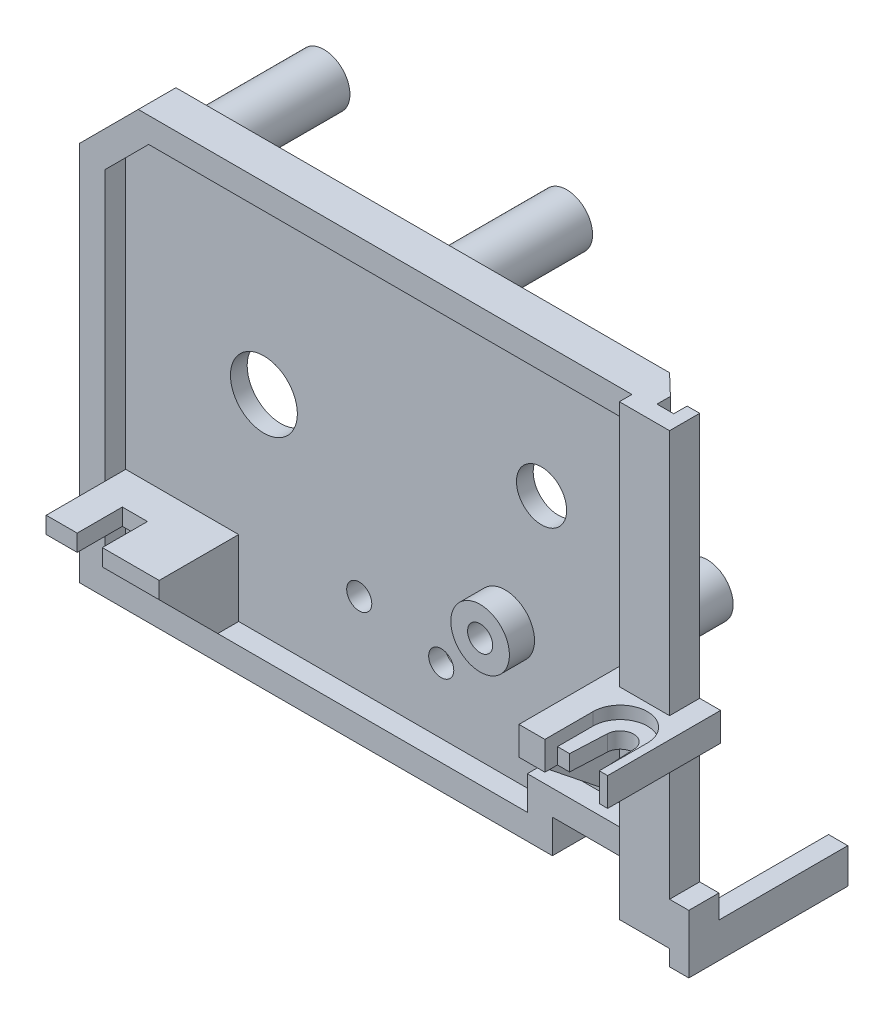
ISO-10303-21;
HEADER;
FILE_DESCRIPTION(('STEP AP214'),'2;1');
FILE_NAME('part.step','',(''),(''),'','','');
FILE_SCHEMA(('AUTOMOTIVE_DESIGN { 1 0 10303 214 1 1 1 1 }'));
ENDSEC;
DATA;
#1=APPLICATION_CONTEXT('core data for automotive mechanical design processes');
#2=APPLICATION_PROTOCOL_DEFINITION('international standard','automotive_design',2000,#1);
#3=PRODUCT_CONTEXT('',#1,'mechanical');
#4=PRODUCT('Part','Part','',(#3));
#5=PRODUCT_RELATED_PRODUCT_CATEGORY('part','',(#4));
#6=PRODUCT_DEFINITION_FORMATION('','',#4);
#7=PRODUCT_DEFINITION_CONTEXT('part definition',#1,'design');
#8=PRODUCT_DEFINITION('design','',#6,#7);
#9=PRODUCT_DEFINITION_SHAPE('','',#8);
#10=(LENGTH_UNIT() NAMED_UNIT(*) SI_UNIT(.MILLI.,.METRE.));
#11=(NAMED_UNIT(*) PLANE_ANGLE_UNIT() SI_UNIT($,.RADIAN.));
#12=(NAMED_UNIT(*) SI_UNIT($,.STERADIAN.) SOLID_ANGLE_UNIT());
#13=UNCERTAINTY_MEASURE_WITH_UNIT(LENGTH_MEASURE(1.E-05),#10,'distance_accuracy_value','');
#14=(GEOMETRIC_REPRESENTATION_CONTEXT(3) GLOBAL_UNCERTAINTY_ASSIGNED_CONTEXT((#13)) GLOBAL_UNIT_ASSIGNED_CONTEXT((#10,
#11,#12)) REPRESENTATION_CONTEXT('',''));
#15=CARTESIAN_POINT('',(0.,0.,0.));
#16=DIRECTION('',(0.,0.,1.));
#17=DIRECTION('',(1.,0.,0.));
#18=AXIS2_PLACEMENT_3D('',#15,#16,#17);
#19=CARTESIAN_POINT('',(24.6764478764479,-16.2265444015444,0.));
#20=DIRECTION('',(0.,0.,-1.));
#21=DIRECTION('',(-1.,0.,0.));
#22=AXIS2_PLACEMENT_3D('',#19,#20,#21);
#23=PLANE('',#22);
#24=CARTESIAN_POINT('',(-20.5235521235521,-10.2265444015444,0.));
#25=DIRECTION('',(0.,0.,-1.));
#26=DIRECTION('',(-1.,0.,0.));
#27=AXIS2_PLACEMENT_3D('',#24,#25,#26);
#28=CIRCLE('',#27,3.1);
#29=CARTESIAN_POINT('',(-23.6235521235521,-10.2265444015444,0.));
#30=VERTEX_POINT('',#29);
#31=EDGE_CURVE('E480',#30,#30,#28,.T.);
#32=ORIENTED_EDGE('',*,*,#31,.F.);
#33=EDGE_LOOP('',(#32));
#34=FACE_BOUND('',#33,.T.);
#35=CARTESIAN_POINT('',(7.17644787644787,31.2734555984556,0.));
#36=DIRECTION('',(0.,0.,-1.));
#37=DIRECTION('',(-1.,0.,0.));
#38=AXIS2_PLACEMENT_3D('',#35,#36,#37);
#39=CIRCLE('',#38,3.1);
#40=CARTESIAN_POINT('',(4.07644787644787,31.2734555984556,0.));
#41=VERTEX_POINT('',#40);
#42=EDGE_CURVE('E492',#41,#41,#39,.T.);
#43=ORIENTED_EDGE('',*,*,#42,.F.);
#44=EDGE_LOOP('',(#43));
#45=FACE_BOUND('',#44,.T.);
#46=DIRECTION('',(-0.707106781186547,-0.707106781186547,0.));
#47=VECTOR('',#46,1.);
#48=CARTESIAN_POINT('',(-31.8235521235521,29.2734555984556,0.));
#49=LINE('',#48,#47);
#50=CARTESIAN_POINT('',(-24.8235521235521,36.2734555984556,0.));
#51=VERTEX_POINT('',#50);
#52=CARTESIAN_POINT('',(-31.8235521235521,29.2734555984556,0.));
#53=VERTEX_POINT('',#52);
#54=EDGE_CURVE('E905',#51,#53,#49,.T.);
#55=ORIENTED_EDGE('',*,*,#54,.F.);
#56=DIRECTION('',(-1.,0.,0.));
#57=VECTOR('',#56,1.);
#58=CARTESIAN_POINT('',(-24.8235521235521,36.2734555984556,0.));
#59=LINE('',#58,#57);
#60=CARTESIAN_POINT('',(34.1764478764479,36.2734555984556,0.));
#61=VERTEX_POINT('',#60);
#62=EDGE_CURVE('E903',#61,#51,#59,.T.);
#63=ORIENTED_EDGE('',*,*,#62,.F.);
#64=DIRECTION('',(0.,1.,0.));
#65=VECTOR('',#64,1.);
#66=CARTESIAN_POINT('',(34.1764478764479,36.2734555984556,0.));
#67=LINE('',#66,#65);
#68=CARTESIAN_POINT('',(34.1764478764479,-12.2265444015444,0.));
#69=VERTEX_POINT('',#68);
#70=EDGE_CURVE('E906',#69,#61,#67,.T.);
#71=ORIENTED_EDGE('',*,*,#70,.F.);
#72=DIRECTION('',(1.,0.,0.));
#73=VECTOR('',#72,1.);
#74=CARTESIAN_POINT('',(34.1764478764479,-12.2265444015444,0.));
#75=LINE('',#74,#73);
#76=CARTESIAN_POINT('',(24.6764478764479,-12.2265444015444,0.));
#77=VERTEX_POINT('',#76);
#78=EDGE_CURVE('E902',#77,#69,#75,.T.);
#79=ORIENTED_EDGE('',*,*,#78,.F.);
#80=DIRECTION('',(0.,1.,0.));
#81=VECTOR('',#80,1.);
#82=CARTESIAN_POINT('',(24.6764478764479,-12.2265444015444,0.));
#83=LINE('',#82,#81);
#84=CARTESIAN_POINT('',(24.6764478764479,-16.2265444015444,0.));
#85=VERTEX_POINT('',#84);
#86=EDGE_CURVE('E900',#85,#77,#83,.T.);
#87=ORIENTED_EDGE('',*,*,#86,.F.);
#88=DIRECTION('',(1.,0.,0.));
#89=VECTOR('',#88,1.);
#90=CARTESIAN_POINT('',(-31.8235521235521,-16.2265444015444,0.));
#91=LINE('',#90,#89);
#92=CARTESIAN_POINT('',(-31.8235521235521,-16.2265444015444,0.));
#93=VERTEX_POINT('',#92);
#94=EDGE_CURVE('E883',#93,#85,#91,.T.);
#95=ORIENTED_EDGE('',*,*,#94,.F.);
#96=DIRECTION('',(0.,-1.,0.));
#97=VECTOR('',#96,1.);
#98=CARTESIAN_POINT('',(-31.8235521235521,-16.2265444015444,0.));
#99=LINE('',#98,#97);
#100=CARTESIAN_POINT('',(-31.8235521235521,-7.22654440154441,0.));
#101=VERTEX_POINT('',#100);
#102=EDGE_CURVE('E908',#101,#93,#99,.T.);
#103=ORIENTED_EDGE('',*,*,#102,.F.);
#104=CARTESIAN_POINT('',(-31.8235521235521,1.77345559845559,0.));
#105=VERTEX_POINT('',#104);
#106=EDGE_CURVE('E913',#105,#101,#99,.T.);
#107=ORIENTED_EDGE('',*,*,#106,.F.);
#108=EDGE_CURVE('E909',#53,#105,#99,.T.);
#109=ORIENTED_EDGE('',*,*,#108,.F.);
#110=EDGE_LOOP('',(#55,#63,#71,#79,#87,#95,#103,#107,#109));
#111=FACE_BOUND('',#110,.T.);
#112=CARTESIAN_POINT('',(-21.8235521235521,31.2734555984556,0.));
#113=DIRECTION('',(0.,0.,-1.));
#114=DIRECTION('',(-1.,0.,0.));
#115=AXIS2_PLACEMENT_3D('',#112,#113,#114);
#116=CIRCLE('',#115,3.1);
#117=CARTESIAN_POINT('',(-24.9235521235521,31.2734555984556,0.));
#118=VERTEX_POINT('',#117);
#119=EDGE_CURVE('E498',#118,#118,#116,.T.);
#120=ORIENTED_EDGE('',*,*,#119,.F.);
#121=EDGE_LOOP('',(#120));
#122=FACE_BOUND('',#121,.T.);
#123=CARTESIAN_POINT('',(23.9764478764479,1.37345559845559,0.));
#124=DIRECTION('',(0.,0.,-1.));
#125=DIRECTION('',(-1.,0.,0.));
#126=AXIS2_PLACEMENT_3D('',#123,#124,#125);
#127=CIRCLE('',#126,3.1);
#128=CARTESIAN_POINT('',(20.8764478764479,1.37345559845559,0.));
#129=VERTEX_POINT('',#128);
#130=EDGE_CURVE('E486',#129,#129,#127,.T.);
#131=ORIENTED_EDGE('',*,*,#130,.F.);
#132=EDGE_LOOP('',(#131));
#133=FACE_BOUND('',#132,.T.);
#134=CARTESIAN_POINT('',(20.8764478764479,17.8734555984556,0.));
#135=DIRECTION('',(0.,0.,-1.));
#136=DIRECTION('',(-1.,0.,0.));
#137=AXIS2_PLACEMENT_3D('',#134,#135,#136);
#138=CIRCLE('',#137,3.);
#139=CARTESIAN_POINT('',(17.8764478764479,17.8734555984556,0.));
#140=VERTEX_POINT('',#139);
#141=EDGE_CURVE('E453',#140,#140,#138,.T.);
#142=ORIENTED_EDGE('',*,*,#141,.F.);
#143=EDGE_LOOP('',(#142));
#144=FACE_BOUND('',#143,.T.);
#145=CARTESIAN_POINT('',(16.5360884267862,2.47341404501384,0.));
#146=DIRECTION('',(0.,0.,-1.));
#147=DIRECTION('',(-1.,0.,0.));
#148=AXIS2_PLACEMENT_3D('',#145,#146,#147);
#149=CIRCLE('',#148,1.5);
#150=CARTESIAN_POINT('',(15.0360884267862,2.47341404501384,0.));
#151=VERTEX_POINT('',#150);
#152=EDGE_CURVE('E1465',#151,#151,#149,.T.);
#153=ORIENTED_EDGE('',*,*,#152,.F.);
#154=EDGE_LOOP('',(#153));
#155=FACE_BOUND('',#154,.T.);
#156=CARTESIAN_POINT('',(8.88608842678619,-5.43085695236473,0.));
#157=DIRECTION('',(0.,0.,-1.));
#158=DIRECTION('',(-1.,0.,0.));
#159=AXIS2_PLACEMENT_3D('',#156,#157,#158);
#160=CIRCLE('',#159,1.5);
#161=CARTESIAN_POINT('',(7.38608842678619,-5.43085695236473,0.));
#162=VERTEX_POINT('',#161);
#163=EDGE_CURVE('E1461',#162,#162,#160,.T.);
#164=ORIENTED_EDGE('',*,*,#163,.F.);
#165=EDGE_LOOP('',(#164));
#166=FACE_BOUND('',#165,.T.);
#167=CARTESIAN_POINT('',(-12.3065912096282,11.7731011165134,0.));
#168=DIRECTION('',(0.,0.,-1.));
#169=DIRECTION('',(-1.,0.,0.));
#170=AXIS2_PLACEMENT_3D('',#167,#168,#169);
#171=CIRCLE('',#170,4.);
#172=CARTESIAN_POINT('',(-16.3065912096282,11.7731011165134,0.));
#173=VERTEX_POINT('',#172);
#174=EDGE_CURVE('E35',#173,#173,#171,.T.);
#175=ORIENTED_EDGE('',*,*,#174,.F.);
#176=EDGE_LOOP('',(#175));
#177=FACE_BOUND('',#176,.T.);
#178=CARTESIAN_POINT('',(-0.91187054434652,-3.43085695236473,0.));
#179=DIRECTION('',(0.,0.,-1.));
#180=DIRECTION('',(-1.,0.,0.));
#181=AXIS2_PLACEMENT_3D('',#178,#179,#180);
#182=CIRCLE('',#181,2.25);
#183=CARTESIAN_POINT('',(-3.16187054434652,-3.43085695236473,0.));
#184=VERTEX_POINT('',#183);
#185=EDGE_CURVE('E1446',#184,#184,#182,.T.);
#186=ORIENTED_EDGE('',*,*,#185,.F.);
#187=EDGE_LOOP('',(#186));
#188=FACE_BOUND('',#187,.T.);
#189=ADVANCED_FACE('F31',(#34,#45,#111,#122,#133,#144,#155,#166,#177,#188),#23,.T.);
#190=CARTESIAN_POINT('',(-28.8235521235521,28.0308149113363,2.));
#191=DIRECTION('',(0.,0.,1.));
#192=DIRECTION('',(1.,0.,0.));
#193=AXIS2_PLACEMENT_3D('',#190,#191,#192);
#194=PLANE('',#193);
#195=CARTESIAN_POINT('',(-12.3065912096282,11.7731011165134,2.));
#196=DIRECTION('',(0.,0.,1.));
#197=DIRECTION('',(1.,0.,0.));
#198=AXIS2_PLACEMENT_3D('',#195,#196,#197);
#199=CIRCLE('',#198,4.);
#200=CARTESIAN_POINT('',(-8.30659120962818,11.7731011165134,2.));
#201=VERTEX_POINT('',#200);
#202=EDGE_CURVE('E1452',#201,#201,#199,.T.);
#203=ORIENTED_EDGE('',*,*,#202,.F.);
#204=EDGE_LOOP('',(#203));
#205=FACE_BOUND('',#204,.T.);
#206=CARTESIAN_POINT('',(-0.91187054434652,-3.43085695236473,2.));
#207=DIRECTION('',(0.,0.,1.));
#208=DIRECTION('',(1.,0.,0.));
#209=AXIS2_PLACEMENT_3D('',#206,#207,#208);
#210=CIRCLE('',#209,1.5);
#211=CARTESIAN_POINT('',(0.588129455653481,-3.43085695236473,2.));
#212=VERTEX_POINT('',#211);
#213=EDGE_CURVE('E1455',#212,#212,#210,.T.);
#214=ORIENTED_EDGE('',*,*,#213,.F.);
#215=EDGE_LOOP('',(#214));
#216=FACE_BOUND('',#215,.T.);
#217=CARTESIAN_POINT('',(8.88608842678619,-5.43085695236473,2.));
#218=DIRECTION('',(0.,0.,1.));
#219=DIRECTION('',(1.,0.,0.));
#220=AXIS2_PLACEMENT_3D('',#217,#218,#219);
#221=CIRCLE('',#220,1.5);
#222=CARTESIAN_POINT('',(10.3860884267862,-5.43085695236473,2.));
#223=VERTEX_POINT('',#222);
#224=EDGE_CURVE('E1458',#223,#223,#221,.T.);
#225=ORIENTED_EDGE('',*,*,#224,.F.);
#226=EDGE_LOOP('',(#225));
#227=FACE_BOUND('',#226,.T.);
#228=DIRECTION('',(0.,-1.,0.));
#229=VECTOR('',#228,1.);
#230=CARTESIAN_POINT('',(32.0764478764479,3.37345559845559,2.00000000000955));
#231=LINE('',#230,#229);
#232=CARTESIAN_POINT('',(32.0764478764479,6.77345559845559,1.99999999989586));
#233=VERTEX_POINT('',#232);
#234=CARTESIAN_POINT('',(32.0764478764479,-7.72654440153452,2.));
#235=VERTEX_POINT('',#234);
#236=EDGE_CURVE('E588',#233,#235,#231,.T.);
#237=ORIENTED_EDGE('',*,*,#236,.F.);
#238=DIRECTION('',(-1.,0.,0.));
#239=VECTOR('',#238,1.);
#240=CARTESIAN_POINT('',(32.0764478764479,6.77345559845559,2.00000000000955));
#241=LINE('',#240,#239);
#242=CARTESIAN_POINT('',(34.1764478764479,6.77345559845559,1.99999999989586));
#243=VERTEX_POINT('',#242);
#244=EDGE_CURVE('E587',#243,#233,#241,.T.);
#245=ORIENTED_EDGE('',*,*,#244,.F.);
#246=DIRECTION('',(0.,1.,0.));
#247=VECTOR('',#246,1.);
#248=CARTESIAN_POINT('',(34.1764478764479,-9.22654440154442,2.));
#249=LINE('',#248,#247);
#250=CARTESIAN_POINT('',(34.1764478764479,33.2734555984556,2.));
#251=VERTEX_POINT('',#250);
#252=EDGE_CURVE('E873',#243,#251,#249,.T.);
#253=ORIENTED_EDGE('',*,*,#252,.T.);
#254=DIRECTION('',(-1.,0.,0.));
#255=VECTOR('',#254,1.);
#256=CARTESIAN_POINT('',(34.1764478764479,33.2734555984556,2.));
#257=LINE('',#256,#255);
#258=CARTESIAN_POINT('',(-23.5809114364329,33.2734555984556,2.));
#259=VERTEX_POINT('',#258);
#260=EDGE_CURVE('E877',#251,#259,#257,.T.);
#261=ORIENTED_EDGE('',*,*,#260,.T.);
#262=DIRECTION('',(-0.707106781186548,-0.707106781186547,0.));
#263=VECTOR('',#262,1.);
#264=CARTESIAN_POINT('',(-23.5809114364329,33.2734555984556,2.));
#265=LINE('',#264,#263);
#266=CARTESIAN_POINT('',(-28.8235521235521,28.0308149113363,2.));
#267=VERTEX_POINT('',#266);
#268=EDGE_CURVE('E856',#259,#267,#265,.T.);
#269=ORIENTED_EDGE('',*,*,#268,.T.);
#270=DIRECTION('',(0.,-1.,0.));
#271=VECTOR('',#270,1.);
#272=CARTESIAN_POINT('',(-28.8235521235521,28.0308149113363,2.));
#273=LINE('',#272,#271);
#274=CARTESIAN_POINT('',(-28.8235521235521,-4.22654440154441,2.));
#275=VERTEX_POINT('',#274);
#276=EDGE_CURVE('E860',#267,#275,#273,.T.);
#277=ORIENTED_EDGE('',*,*,#276,.T.);
#278=DIRECTION('',(-1.,0.,0.));
#279=VECTOR('',#278,1.);
#280=CARTESIAN_POINT('',(-28.8235521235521,-4.22654440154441,2.));
#281=LINE('',#280,#279);
#282=CARTESIAN_POINT('',(-15.3235521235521,-4.22654440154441,2.));
#283=VERTEX_POINT('',#282);
#284=EDGE_CURVE('E758',#283,#275,#281,.T.);
#285=ORIENTED_EDGE('',*,*,#284,.F.);
#286=DIRECTION('',(0.,1.,0.));
#287=VECTOR('',#286,1.);
#288=CARTESIAN_POINT('',(-15.3235521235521,-4.22654440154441,2.));
#289=LINE('',#288,#287);
#290=CARTESIAN_POINT('',(-15.3235521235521,-13.2265444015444,2.));
#291=VERTEX_POINT('',#290);
#292=EDGE_CURVE('E755',#291,#283,#289,.T.);
#293=ORIENTED_EDGE('',*,*,#292,.F.);
#294=DIRECTION('',(1.,0.,0.));
#295=VECTOR('',#294,1.);
#296=CARTESIAN_POINT('',(-28.8235521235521,-13.2265444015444,2.));
#297=LINE('',#296,#295);
#298=CARTESIAN_POINT('',(21.6764478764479,-13.2265444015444,2.));
#299=VERTEX_POINT('',#298);
#300=EDGE_CURVE('E863',#291,#299,#297,.T.);
#301=ORIENTED_EDGE('',*,*,#300,.T.);
#302=DIRECTION('',(0.,1.,0.));
#303=VECTOR('',#302,1.);
#304=CARTESIAN_POINT('',(21.6764478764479,-13.2265444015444,2.));
#305=LINE('',#304,#303);
#306=CARTESIAN_POINT('',(21.6764478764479,-9.22654440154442,2.));
#307=VERTEX_POINT('',#306);
#308=EDGE_CURVE('E867',#299,#307,#305,.T.);
#309=ORIENTED_EDGE('',*,*,#308,.T.);
#310=DIRECTION('',(1.,0.,0.));
#311=VECTOR('',#310,1.);
#312=CARTESIAN_POINT('',(21.6764478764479,-9.22654440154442,2.));
#313=LINE('',#312,#311);
#314=CARTESIAN_POINT('',(34.1764478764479,-9.22654440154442,2.));
#315=VERTEX_POINT('',#314);
#316=EDGE_CURVE('E870',#307,#315,#313,.T.);
#317=ORIENTED_EDGE('',*,*,#316,.T.);
#318=CARTESIAN_POINT('',(34.1764478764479,3.37345559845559,1.99999999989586));
#319=VERTEX_POINT('',#318);
#320=EDGE_CURVE('E874',#315,#319,#249,.T.);
#321=ORIENTED_EDGE('',*,*,#320,.T.);
#322=DIRECTION('',(1.,0.,0.));
#323=VECTOR('',#322,1.);
#324=CARTESIAN_POINT('',(34.1764478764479,3.37345559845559,2.00000000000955));
#325=LINE('',#324,#323);
#326=CARTESIAN_POINT('',(33.0764478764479,3.37345559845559,1.99999999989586));
#327=VERTEX_POINT('',#326);
#328=EDGE_CURVE('E585',#327,#319,#325,.T.);
#329=ORIENTED_EDGE('',*,*,#328,.F.);
#330=DIRECTION('',(0.,-1.,0.));
#331=VECTOR('',#330,1.);
#332=CARTESIAN_POINT('',(33.0764478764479,28.0308149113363,2.));
#333=LINE('',#332,#331);
#334=CARTESIAN_POINT('',(33.0764478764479,-7.72654440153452,2.));
#335=VERTEX_POINT('',#334);
#336=EDGE_CURVE('E510',#327,#335,#333,.T.);
#337=ORIENTED_EDGE('',*,*,#336,.T.);
#338=DIRECTION('',(-1.,0.,0.));
#339=VECTOR('',#338,1.);
#340=CARTESIAN_POINT('',(-28.8235521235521,-7.72654440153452,2.));
#341=LINE('',#340,#339);
#342=EDGE_CURVE('E513',#235,#335,#341,.F.);
#343=ORIENTED_EDGE('',*,*,#342,.F.);
#344=EDGE_LOOP('',(#237,#245,#253,#261,#269,#277,#285,#293,#301,#309,#317,#321,#329,#337,#343));
#345=FACE_BOUND('',#344,.T.);
#346=CARTESIAN_POINT('',(20.8764478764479,17.8734555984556,2.));
#347=DIRECTION('',(0.,0.,1.));
#348=DIRECTION('',(1.,0.,0.));
#349=AXIS2_PLACEMENT_3D('',#346,#347,#348);
#350=CIRCLE('',#349,3.);
#351=CARTESIAN_POINT('',(23.8764478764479,17.8734555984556,2.));
#352=VERTEX_POINT('',#351);
#353=EDGE_CURVE('E459',#352,#352,#350,.T.);
#354=ORIENTED_EDGE('',*,*,#353,.F.);
#355=EDGE_LOOP('',(#354));
#356=FACE_BOUND('',#355,.T.);
#357=CARTESIAN_POINT('',(16.5360884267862,2.47341404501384,2.));
#358=DIRECTION('',(0.,0.,1.));
#359=DIRECTION('',(1.,0.,0.));
#360=AXIS2_PLACEMENT_3D('',#357,#358,#359);
#361=CIRCLE('',#360,3.5);
#362=CARTESIAN_POINT('',(20.0360884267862,2.47341404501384,2.));
#363=VERTEX_POINT('',#362);
#364=EDGE_CURVE('E1468',#363,#363,#361,.T.);
#365=ORIENTED_EDGE('',*,*,#364,.F.);
#366=EDGE_LOOP('',(#365));
#367=FACE_BOUND('',#366,.T.);
#368=ADVANCED_FACE('F974',(#205,#216,#227,#345,#356,#367),#194,.T.);
#369=CARTESIAN_POINT('',(32.0764478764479,3.37345559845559,15.9));
#370=DIRECTION('',(0.,1.,0.));
#371=DIRECTION('',(0.,0.,1.));
#372=AXIS2_PLACEMENT_3D('',#369,#370,#371);
#373=PLANE('',#372);
#374=DIRECTION('',(0.,0.,1.));
#375=VECTOR('',#374,1.);
#376=CARTESIAN_POINT('',(33.0764478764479,3.37345559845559,15.9));
#377=LINE('',#376,#375);
#378=CARTESIAN_POINT('',(33.0764478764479,3.37345559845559,15.9));
#379=VERTEX_POINT('',#378);
#380=EDGE_CURVE('E508',#327,#379,#377,.T.);
#381=ORIENTED_EDGE('',*,*,#380,.F.);
#382=ORIENTED_EDGE('',*,*,#328,.T.);
#383=DIRECTION('',(0.,0.,1.));
#384=VECTOR('',#383,1.);
#385=CARTESIAN_POINT('',(34.1764478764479,3.37345559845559,-500000.));
#386=LINE('',#385,#384);
#387=CARTESIAN_POINT('',(34.1764478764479,3.37345559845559,6.00000000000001));
#388=VERTEX_POINT('',#387);
#389=EDGE_CURVE('E578',#319,#388,#386,.T.);
#390=ORIENTED_EDGE('',*,*,#389,.T.);
#391=DIRECTION('',(1.,0.,0.));
#392=VECTOR('',#391,1.);
#393=CARTESIAN_POINT('',(32.0764478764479,3.37345559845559,6.00000000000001));
#394=LINE('',#393,#392);
#395=CARTESIAN_POINT('',(40.1764478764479,3.37345559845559,6.00000000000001));
#396=VERTEX_POINT('',#395);
#397=EDGE_CURVE('E40',#388,#396,#394,.T.);
#398=ORIENTED_EDGE('',*,*,#397,.T.);
#399=DIRECTION('',(0.,0.,1.));
#400=VECTOR('',#399,1.);
#401=CARTESIAN_POINT('',(40.1764478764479,3.37345559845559,-1.82018956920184));
#402=LINE('',#401,#400);
#403=CARTESIAN_POINT('',(40.1764478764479,3.37345559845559,2.4));
#404=VERTEX_POINT('',#403);
#405=EDGE_CURVE('E590',#404,#396,#402,.T.);
#406=ORIENTED_EDGE('',*,*,#405,.F.);
#407=DIRECTION('',(-1.,0.,0.));
#408=VECTOR('',#407,1.);
#409=CARTESIAN_POINT('',(40.1764478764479,3.37345559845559,2.4));
#410=LINE('',#409,#408);
#411=CARTESIAN_POINT('',(42.6764478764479,3.37345559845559,2.4));
#412=VERTEX_POINT('',#411);
#413=EDGE_CURVE('E599',#412,#404,#410,.T.);
#414=ORIENTED_EDGE('',*,*,#413,.F.);
#415=DIRECTION('',(0.,0.,-1.));
#416=VECTOR('',#415,1.);
#417=CARTESIAN_POINT('',(42.6764478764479,3.37345559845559,15.9));
#418=LINE('',#417,#416);
#419=CARTESIAN_POINT('',(42.6764478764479,3.37345559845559,15.9));
#420=VERTEX_POINT('',#419);
#421=EDGE_CURVE('E629',#420,#412,#418,.T.);
#422=ORIENTED_EDGE('',*,*,#421,.F.);
#423=DIRECTION('',(1.,0.,0.));
#424=VECTOR('',#423,1.);
#425=CARTESIAN_POINT('',(32.0764478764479,3.37345559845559,15.9));
#426=LINE('',#425,#424);
#427=CARTESIAN_POINT('',(41.6764478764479,3.37345559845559,15.9));
#428=VERTEX_POINT('',#427);
#429=EDGE_CURVE('E613',#428,#420,#426,.T.);
#430=ORIENTED_EDGE('',*,*,#429,.F.);
#431=DIRECTION('',(0.,0.,-1.));
#432=VECTOR('',#431,1.);
#433=CARTESIAN_POINT('',(41.6764478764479,3.37345559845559,15.9));
#434=LINE('',#433,#432);
#435=CARTESIAN_POINT('',(41.6764478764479,3.37345559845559,14.4));
#436=VERTEX_POINT('',#435);
#437=EDGE_CURVE('E550',#428,#436,#434,.T.);
#438=ORIENTED_EDGE('',*,*,#437,.T.);
#439=DIRECTION('',(-1.,0.,0.));
#440=VECTOR('',#439,1.);
#441=CARTESIAN_POINT('',(32.0764478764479,3.37345559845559,14.4));
#442=LINE('',#441,#440);
#443=CARTESIAN_POINT('',(40.2264478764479,3.37345559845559,14.4));
#444=VERTEX_POINT('',#443);
#445=EDGE_CURVE('E553',#436,#444,#442,.T.);
#446=ORIENTED_EDGE('',*,*,#445,.T.);
#447=DIRECTION('',(-0.046598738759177,0.,-0.998913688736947));
#448=VECTOR('',#447,1.);
#449=CARTESIAN_POINT('',(40.2785727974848,3.37345559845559,15.5173756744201));
#450=LINE('',#449,#448);
#451=CARTESIAN_POINT('',(40.024709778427,3.37345559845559,10.0754420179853));
#452=VERTEX_POINT('',#451);
#453=EDGE_CURVE('E556',#444,#452,#450,.T.);
#454=ORIENTED_EDGE('',*,*,#453,.T.);
#455=CARTESIAN_POINT('',(38.4264478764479,3.37345559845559,10.15));
#456=DIRECTION('',(0.,1.,0.));
#457=DIRECTION('',(0.,0.,1.));
#458=AXIS2_PLACEMENT_3D('',#455,#456,#457);
#459=CIRCLE('',#458,1.6);
#460=CARTESIAN_POINT('',(36.8281859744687,3.37345559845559,10.0754420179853));
#461=VERTEX_POINT('',#460);
#462=EDGE_CURVE('E531',#452,#461,#459,.T.);
#463=ORIENTED_EDGE('',*,*,#462,.T.);
#464=DIRECTION('',(0.0465987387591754,0.,-0.998913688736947));
#465=VECTOR('',#464,1.);
#466=CARTESIAN_POINT('',(36.5467456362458,3.37345559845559,16.1085367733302));
#467=LINE('',#466,#465);
#468=CARTESIAN_POINT('',(36.6264478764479,3.37345559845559,14.4));
#469=VERTEX_POINT('',#468);
#470=EDGE_CURVE('E543',#469,#461,#467,.T.);
#471=ORIENTED_EDGE('',*,*,#470,.F.);
#472=DIRECTION('',(1.,0.,0.));
#473=VECTOR('',#472,1.);
#474=CARTESIAN_POINT('',(32.0764478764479,3.37345559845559,14.4));
#475=LINE('',#474,#473);
#476=CARTESIAN_POINT('',(35.1764478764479,3.37345559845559,14.4));
#477=VERTEX_POINT('',#476);
#478=EDGE_CURVE('E545',#477,#469,#475,.T.);
#479=ORIENTED_EDGE('',*,*,#478,.F.);
#480=DIRECTION('',(0.,0.,1.));
#481=VECTOR('',#480,1.);
#482=CARTESIAN_POINT('',(35.1764478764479,3.37345559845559,15.9));
#483=LINE('',#482,#481);
#484=CARTESIAN_POINT('',(35.1764478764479,3.37345559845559,15.9));
#485=VERTEX_POINT('',#484);
#486=EDGE_CURVE('E547',#477,#485,#483,.T.);
#487=ORIENTED_EDGE('',*,*,#486,.T.);
#488=EDGE_CURVE('E618',#379,#485,#426,.T.);
#489=ORIENTED_EDGE('',*,*,#488,.F.);
#490=EDGE_LOOP('',(#381,#382,#390,#398,#406,#414,#422,#430,#438,#446,#454,#463,#471,#479,#487,#489));
#491=FACE_BOUND('',#490,.T.);
#492=ADVANCED_FACE('F1032',(#491),#373,.F.);
#493=CARTESIAN_POINT('',(32.0764478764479,3.37345559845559,15.9));
#494=DIRECTION('',(0.,0.,1.));
#495=DIRECTION('',(1.,0.,0.));
#496=AXIS2_PLACEMENT_3D('',#493,#494,#495);
#497=PLANE('',#496);
#498=DIRECTION('',(0.,1.,0.));
#499=VECTOR('',#498,1.);
#500=CARTESIAN_POINT('',(41.6764478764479,5.27345559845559,15.9));
#501=LINE('',#500,#499);
#502=CARTESIAN_POINT('',(41.6764478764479,6.77345559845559,15.9));
#503=VERTEX_POINT('',#502);
#504=EDGE_CURVE('E581',#428,#503,#501,.T.);
#505=ORIENTED_EDGE('',*,*,#504,.F.);
#506=ORIENTED_EDGE('',*,*,#429,.T.);
#507=DIRECTION('',(0.,1.,0.));
#508=VECTOR('',#507,1.);
#509=CARTESIAN_POINT('',(42.6764478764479,6.77345559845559,15.9));
#510=LINE('',#509,#508);
#511=CARTESIAN_POINT('',(42.6764478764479,6.77345559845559,15.9));
#512=VERTEX_POINT('',#511);
#513=EDGE_CURVE('E617',#420,#512,#510,.T.);
#514=ORIENTED_EDGE('',*,*,#513,.T.);
#515=DIRECTION('',(-1.,0.,0.));
#516=VECTOR('',#515,1.);
#517=CARTESIAN_POINT('',(32.0764478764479,6.77345559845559,15.9));
#518=LINE('',#517,#516);
#519=EDGE_CURVE('E621',#512,#503,#518,.T.);
#520=ORIENTED_EDGE('',*,*,#519,.T.);
#521=EDGE_LOOP('',(#505,#506,#514,#520));
#522=FACE_BOUND('',#521,.T.);
#523=ADVANCED_FACE('F1295',(#522),#497,.T.);
#524=CARTESIAN_POINT('',(34.1764478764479,-17.3265444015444,0.));
#525=DIRECTION('',(-1.,0.,0.));
#526=DIRECTION('',(0.,0.,1.));
#527=AXIS2_PLACEMENT_3D('',#524,#525,#526);
#528=PLANE('',#527);
#529=DIRECTION('',(0.,1.,0.));
#530=VECTOR('',#529,1.);
#531=CARTESIAN_POINT('',(34.1764478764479,-17.3265444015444,6.));
#532=LINE('',#531,#530);
#533=CARTESIAN_POINT('',(34.1764478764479,-17.3265444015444,6.));
#534=VERTEX_POINT('',#533);
#535=EDGE_CURVE('E678',#534,#388,#532,.T.);
#536=ORIENTED_EDGE('',*,*,#535,.T.);
#537=ORIENTED_EDGE('',*,*,#389,.F.);
#538=ORIENTED_EDGE('',*,*,#320,.F.);
#539=DIRECTION('',(0.,0.,1.));
#540=VECTOR('',#539,1.);
#541=CARTESIAN_POINT('',(34.1764478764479,-9.22654440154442,2.));
#542=LINE('',#541,#540);
#543=CARTESIAN_POINT('',(34.1764478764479,-9.22654440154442,4.5));
#544=VERTEX_POINT('',#543);
#545=EDGE_CURVE('E886',#315,#544,#542,.T.);
#546=ORIENTED_EDGE('',*,*,#545,.T.);
#547=DIRECTION('',(0.,1.,0.));
#548=VECTOR('',#547,1.);
#549=CARTESIAN_POINT('',(34.1764478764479,36.2734555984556,4.5));
#550=LINE('',#549,#548);
#551=CARTESIAN_POINT('',(34.1764478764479,-12.2265444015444,4.5));
#552=VERTEX_POINT('',#551);
#553=EDGE_CURVE('E921',#552,#544,#550,.T.);
#554=ORIENTED_EDGE('',*,*,#553,.F.);
#555=DIRECTION('',(0.,0.,-1.));
#556=VECTOR('',#555,1.);
#557=CARTESIAN_POINT('',(34.1764478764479,-12.2265444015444,4.5));
#558=LINE('',#557,#556);
#559=EDGE_CURVE('E1078',#552,#69,#558,.T.);
#560=ORIENTED_EDGE('',*,*,#559,.T.);
#561=DIRECTION('',(0.,1.,0.));
#562=VECTOR('',#561,1.);
#563=CARTESIAN_POINT('',(34.1764478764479,-17.3265444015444,0.));
#564=LINE('',#563,#562);
#565=CARTESIAN_POINT('',(34.1764478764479,-17.3265444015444,0.));
#566=VERTEX_POINT('',#565);
#567=EDGE_CURVE('E833',#566,#69,#564,.T.);
#568=ORIENTED_EDGE('',*,*,#567,.F.);
#569=DIRECTION('',(0.,0.,1.));
#570=VECTOR('',#569,1.);
#571=CARTESIAN_POINT('',(34.1764478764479,-17.3265444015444,0.));
#572=LINE('',#571,#570);
#573=EDGE_CURVE('E671',#566,#534,#572,.T.);
#574=ORIENTED_EDGE('',*,*,#573,.T.);
#575=EDGE_LOOP('',(#536,#537,#538,#546,#554,#560,#568,#574));
#576=FACE_BOUND('',#575,.T.);
#577=ADVANCED_FACE('F1243',(#576),#528,.T.);
#578=ORIENTED_EDGE('',*,*,#252,.F.);
#579=DIRECTION('',(0.,0.,1.));
#580=VECTOR('',#579,1.);
#581=CARTESIAN_POINT('',(34.1764478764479,6.77345559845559,-500000.));
#582=LINE('',#581,#580);
#583=CARTESIAN_POINT('',(34.1764478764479,6.77345559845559,6.00000000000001));
#584=VERTEX_POINT('',#583);
#585=EDGE_CURVE('E592',#243,#584,#582,.T.);
#586=ORIENTED_EDGE('',*,*,#585,.T.);
#587=CARTESIAN_POINT('',(34.1764478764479,36.2734555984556,6.));
#588=VERTEX_POINT('',#587);
#589=EDGE_CURVE('E836',#584,#588,#532,.T.);
#590=ORIENTED_EDGE('',*,*,#589,.T.);
#591=DIRECTION('',(0.,0.,1.));
#592=VECTOR('',#591,1.);
#593=CARTESIAN_POINT('',(34.1764478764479,36.2734555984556,0.));
#594=LINE('',#593,#592);
#595=CARTESIAN_POINT('',(34.1764478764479,36.2734555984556,4.5));
#596=VERTEX_POINT('',#595);
#597=EDGE_CURVE('E824',#596,#588,#594,.T.);
#598=ORIENTED_EDGE('',*,*,#597,.F.);
#599=CARTESIAN_POINT('',(34.1764478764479,33.2734555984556,4.5));
#600=VERTEX_POINT('',#599);
#601=EDGE_CURVE('E920',#600,#596,#550,.T.);
#602=ORIENTED_EDGE('',*,*,#601,.F.);
#603=DIRECTION('',(0.,0.,1.));
#604=VECTOR('',#603,1.);
#605=CARTESIAN_POINT('',(34.1764478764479,33.2734555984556,2.));
#606=LINE('',#605,#604);
#607=EDGE_CURVE('E884',#251,#600,#606,.T.);
#608=ORIENTED_EDGE('',*,*,#607,.F.);
#609=EDGE_LOOP('',(#578,#586,#590,#598,#602,#608));
#610=FACE_BOUND('',#609,.T.);
#611=ADVANCED_FACE('F1729',(#610),#528,.T.);
#612=CARTESIAN_POINT('',(40.1764478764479,-17.3265444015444,6.));
#613=DIRECTION('',(1.,0.,0.));
#614=DIRECTION('',(0.,0.,-1.));
#615=AXIS2_PLACEMENT_3D('',#612,#613,#614);
#616=PLANE('',#615);
#617=DIRECTION('',(0.,1.,0.));
#618=VECTOR('',#617,1.);
#619=CARTESIAN_POINT('',(40.1764478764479,-17.3265444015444,2.4));
#620=LINE('',#619,#618);
#621=CARTESIAN_POINT('',(40.1764478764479,-12.2265444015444,2.4));
#622=VERTEX_POINT('',#621);
#623=EDGE_CURVE('E695',#622,#404,#620,.T.);
#624=ORIENTED_EDGE('',*,*,#623,.T.);
#625=ORIENTED_EDGE('',*,*,#405,.T.);
#626=DIRECTION('',(0.,1.,0.));
#627=VECTOR('',#626,1.);
#628=CARTESIAN_POINT('',(40.1764478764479,-17.3265444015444,6.));
#629=LINE('',#628,#627);
#630=CARTESIAN_POINT('',(40.1764478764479,-12.2265444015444,6.));
#631=VERTEX_POINT('',#630);
#632=EDGE_CURVE('E677',#631,#396,#629,.T.);
#633=ORIENTED_EDGE('',*,*,#632,.F.);
#634=DIRECTION('',(0.,0.,1.));
#635=VECTOR('',#634,1.);
#636=CARTESIAN_POINT('',(40.1764478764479,-12.2265444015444,2.4));
#637=LINE('',#636,#635);
#638=EDGE_CURVE('E631',#622,#631,#637,.T.);
#639=ORIENTED_EDGE('',*,*,#638,.F.);
#640=EDGE_LOOP('',(#624,#625,#633,#639));
#641=FACE_BOUND('',#640,.T.);
#642=ADVANCED_FACE('F1206',(#641),#616,.T.);
#643=CARTESIAN_POINT('',(40.1764478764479,6.77345559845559,6.00000000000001));
#644=VERTEX_POINT('',#643);
#645=CARTESIAN_POINT('',(40.1764478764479,36.2734555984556,6.));
#646=VERTEX_POINT('',#645);
#647=EDGE_CURVE('E674',#644,#646,#629,.T.);
#648=ORIENTED_EDGE('',*,*,#647,.F.);
#649=DIRECTION('',(0.,0.,1.));
#650=VECTOR('',#649,1.);
#651=CARTESIAN_POINT('',(40.1764478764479,6.77345559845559,-1.82018956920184));
#652=LINE('',#651,#650);
#653=CARTESIAN_POINT('',(40.1764478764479,6.77345559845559,2.4));
#654=VERTEX_POINT('',#653);
#655=EDGE_CURVE('E605',#654,#644,#652,.T.);
#656=ORIENTED_EDGE('',*,*,#655,.F.);
#657=CARTESIAN_POINT('',(40.1764478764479,36.2734555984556,2.4));
#658=VERTEX_POINT('',#657);
#659=EDGE_CURVE('E679',#654,#658,#620,.T.);
#660=ORIENTED_EDGE('',*,*,#659,.T.);
#661=DIRECTION('',(0.,0.,-1.));
#662=VECTOR('',#661,1.);
#663=CARTESIAN_POINT('',(40.1764478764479,36.2734555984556,6.));
#664=LINE('',#663,#662);
#665=EDGE_CURVE('E1179',#646,#658,#664,.T.);
#666=ORIENTED_EDGE('',*,*,#665,.F.);
#667=EDGE_LOOP('',(#648,#656,#660,#666));
#668=FACE_BOUND('',#667,.T.);
#669=ADVANCED_FACE('F1016',(#668),#616,.T.);
#670=CARTESIAN_POINT('',(34.1764478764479,-17.3265444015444,6.));
#671=DIRECTION('',(0.,0.,1.));
#672=DIRECTION('',(1.,0.,0.));
#673=AXIS2_PLACEMENT_3D('',#670,#671,#672);
#674=PLANE('',#673);
#675=DIRECTION('',(-1.,0.,0.));
#676=VECTOR('',#675,1.);
#677=CARTESIAN_POINT('',(32.0764478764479,6.77345559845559,6.00000000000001));
#678=LINE('',#677,#676);
#679=EDGE_CURVE('E11',#644,#584,#678,.T.);
#680=ORIENTED_EDGE('',*,*,#679,.F.);
#681=ORIENTED_EDGE('',*,*,#647,.T.);
#682=DIRECTION('',(1.,0.,0.));
#683=VECTOR('',#682,1.);
#684=CARTESIAN_POINT('',(34.1764478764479,36.2734555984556,6.));
#685=LINE('',#684,#683);
#686=EDGE_CURVE('E827',#588,#646,#685,.T.);
#687=ORIENTED_EDGE('',*,*,#686,.F.);
#688=ORIENTED_EDGE('',*,*,#589,.F.);
#689=EDGE_LOOP('',(#680,#681,#687,#688));
#690=FACE_BOUND('',#689,.T.);
#691=ADVANCED_FACE('F1007',(#690),#674,.T.);
#692=CARTESIAN_POINT('',(-28.8235521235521,-6.22654440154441,11.5));
#693=DIRECTION('',(0.,0.,1.));
#694=DIRECTION('',(1.,0.,0.));
#695=AXIS2_PLACEMENT_3D('',#692,#693,#694);
#696=PLANE('',#695);
#697=DIRECTION('',(0.,-1.,0.));
#698=VECTOR('',#697,1.);
#699=CARTESIAN_POINT('',(-25.1235521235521,-6.22654440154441,11.5));
#700=LINE('',#699,#698);
#701=CARTESIAN_POINT('',(-25.1235521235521,-4.22654440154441,11.5));
#702=VERTEX_POINT('',#701);
#703=CARTESIAN_POINT('',(-25.1235521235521,-6.22654440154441,11.5));
#704=VERTEX_POINT('',#703);
#705=EDGE_CURVE('E937',#702,#704,#700,.T.);
#706=ORIENTED_EDGE('',*,*,#705,.F.);
#707=DIRECTION('',(-1.,0.,0.));
#708=VECTOR('',#707,1.);
#709=CARTESIAN_POINT('',(-28.8235521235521,-4.22654440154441,11.5));
#710=LINE('',#709,#708);
#711=CARTESIAN_POINT('',(-28.8235521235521,-4.22654440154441,11.5));
#712=VERTEX_POINT('',#711);
#713=EDGE_CURVE('E770',#702,#712,#710,.T.);
#714=ORIENTED_EDGE('',*,*,#713,.T.);
#715=DIRECTION('',(0.,-1.,0.));
#716=VECTOR('',#715,1.);
#717=CARTESIAN_POINT('',(-28.8235521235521,-4.22654440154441,11.5));
#718=LINE('',#717,#716);
#719=CARTESIAN_POINT('',(-28.8235521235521,-6.22654440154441,11.5));
#720=VERTEX_POINT('',#719);
#721=EDGE_CURVE('E760',#712,#720,#718,.T.);
#722=ORIENTED_EDGE('',*,*,#721,.T.);
#723=DIRECTION('',(1.,0.,0.));
#724=VECTOR('',#723,1.);
#725=CARTESIAN_POINT('',(-28.8235521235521,-6.22654440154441,11.5));
#726=LINE('',#725,#724);
#727=EDGE_CURVE('E764',#720,#704,#726,.T.);
#728=ORIENTED_EDGE('',*,*,#727,.T.);
#729=EDGE_LOOP('',(#706,#714,#722,#728));
#730=FACE_BOUND('',#729,.T.);
#731=ADVANCED_FACE('F1005',(#730),#696,.T.);
#732=CARTESIAN_POINT('',(-28.8235521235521,-13.2265444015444,2.));
#733=VERTEX_POINT('',#732);
#734=CARTESIAN_POINT('',(-17.3235521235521,-13.2265444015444,2.));
#735=VERTEX_POINT('',#734);
#736=EDGE_CURVE('E864',#733,#735,#297,.T.);
#737=ORIENTED_EDGE('',*,*,#736,.T.);
#738=DIRECTION('',(0.,1.,0.));
#739=VECTOR('',#738,1.);
#740=CARTESIAN_POINT('',(-17.3235521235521,28.0308149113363,2.));
#741=LINE('',#740,#739);
#742=CARTESIAN_POINT('',(-17.3235521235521,-6.22654440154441,2.));
#743=VERTEX_POINT('',#742);
#744=EDGE_CURVE('E741',#735,#743,#741,.T.);
#745=ORIENTED_EDGE('',*,*,#744,.T.);
#746=DIRECTION('',(1.,0.,0.));
#747=VECTOR('',#746,1.);
#748=CARTESIAN_POINT('',(-28.8235521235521,-6.22654440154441,2.));
#749=LINE('',#748,#747);
#750=CARTESIAN_POINT('',(-28.8235521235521,-6.22654440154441,2.));
#751=VERTEX_POINT('',#750);
#752=EDGE_CURVE('E752',#751,#743,#749,.T.);
#753=ORIENTED_EDGE('',*,*,#752,.F.);
#754=EDGE_CURVE('E859',#751,#733,#273,.T.);
#755=ORIENTED_EDGE('',*,*,#754,.T.);
#756=EDGE_LOOP('',(#737,#745,#753,#755));
#757=FACE_BOUND('',#756,.T.);
#758=ADVANCED_FACE('F1002',(#757),#194,.T.);
#759=CARTESIAN_POINT('',(-28.8235521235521,-13.2265444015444,2.));
#760=DIRECTION('',(0.,-1.,0.));
#761=DIRECTION('',(0.,0.,-1.));
#762=AXIS2_PLACEMENT_3D('',#759,#760,#761);
#763=PLANE('',#762);
#764=DIRECTION('',(0.,0.,1.));
#765=VECTOR('',#764,1.);
#766=CARTESIAN_POINT('',(-17.3235521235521,-13.2265444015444,2.));
#767=LINE('',#766,#765);
#768=CARTESIAN_POINT('',(-17.3235521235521,-13.2265444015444,4.5));
#769=VERTEX_POINT('',#768);
#770=EDGE_CURVE('E744',#735,#769,#767,.T.);
#771=ORIENTED_EDGE('',*,*,#770,.F.);
#772=ORIENTED_EDGE('',*,*,#736,.F.);
#773=DIRECTION('',(0.,0.,1.));
#774=VECTOR('',#773,1.);
#775=CARTESIAN_POINT('',(-28.8235521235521,-13.2265444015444,2.));
#776=LINE('',#775,#774);
#777=CARTESIAN_POINT('',(-28.8235521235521,-13.2265444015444,4.5));
#778=VERTEX_POINT('',#777);
#779=EDGE_CURVE('E894',#733,#778,#776,.T.);
#780=ORIENTED_EDGE('',*,*,#779,.T.);
#781=DIRECTION('',(1.,0.,0.));
#782=VECTOR('',#781,1.);
#783=CARTESIAN_POINT('',(-28.8235521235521,-13.2265444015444,4.5));
#784=LINE('',#783,#782);
#785=EDGE_CURVE('E846',#778,#769,#784,.T.);
#786=ORIENTED_EDGE('',*,*,#785,.T.);
#787=EDGE_LOOP('',(#771,#772,#780,#786));
#788=FACE_BOUND('',#787,.T.);
#789=ADVANCED_FACE('F1000',(#788),#763,.F.);
#790=CARTESIAN_POINT('',(-28.8235521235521,-6.22654440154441,11.5));
#791=DIRECTION('',(0.,1.,0.));
#792=DIRECTION('',(0.,0.,1.));
#793=AXIS2_PLACEMENT_3D('',#790,#791,#792);
#794=PLANE('',#793);
#795=DIRECTION('',(1.,0.,0.));
#796=VECTOR('',#795,1.);
#797=CARTESIAN_POINT('',(-25.1235521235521,-6.22654440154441,6.1));
#798=LINE('',#797,#796);
#799=CARTESIAN_POINT('',(-25.1235521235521,-6.22654440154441,6.1));
#800=VERTEX_POINT('',#799);
#801=CARTESIAN_POINT('',(-22.1235521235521,-6.22654440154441,6.1));
#802=VERTEX_POINT('',#801);
#803=EDGE_CURVE('E704',#800,#802,#798,.T.);
#804=ORIENTED_EDGE('',*,*,#803,.F.);
#805=DIRECTION('',(0.,0.,-1.));
#806=VECTOR('',#805,1.);
#807=CARTESIAN_POINT('',(-25.1235521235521,-6.22654440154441,11.5));
#808=LINE('',#807,#806);
#809=EDGE_CURVE('E699',#704,#800,#808,.T.);
#810=ORIENTED_EDGE('',*,*,#809,.F.);
#811=ORIENTED_EDGE('',*,*,#727,.F.);
#812=DIRECTION('',(0.,0.,-1.));
#813=VECTOR('',#812,1.);
#814=CARTESIAN_POINT('',(-28.8235521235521,-6.22654440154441,11.5));
#815=LINE('',#814,#813);
#816=CARTESIAN_POINT('',(-28.8235521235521,-6.22654440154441,4.5));
#817=VERTEX_POINT('',#816);
#818=EDGE_CURVE('E781',#720,#817,#815,.T.);
#819=ORIENTED_EDGE('',*,*,#818,.T.);
#820=EDGE_CURVE('E780',#817,#751,#815,.T.);
#821=ORIENTED_EDGE('',*,*,#820,.T.);
#822=ORIENTED_EDGE('',*,*,#752,.T.);
#823=DIRECTION('',(0.,0.,-1.));
#824=VECTOR('',#823,1.);
#825=CARTESIAN_POINT('',(-17.3235521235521,-6.22654440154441,11.5));
#826=LINE('',#825,#824);
#827=CARTESIAN_POINT('',(-17.3235521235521,-6.22654440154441,11.5));
#828=VERTEX_POINT('',#827);
#829=EDGE_CURVE('E739',#828,#743,#826,.T.);
#830=ORIENTED_EDGE('',*,*,#829,.F.);
#831=CARTESIAN_POINT('',(-22.1235521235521,-6.22654440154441,11.5));
#832=VERTEX_POINT('',#831);
#833=EDGE_CURVE('E768',#832,#828,#726,.T.);
#834=ORIENTED_EDGE('',*,*,#833,.F.);
#835=DIRECTION('',(0.,0.,1.));
#836=VECTOR('',#835,1.);
#837=CARTESIAN_POINT('',(-22.1235521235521,-6.22654440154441,11.5));
#838=LINE('',#837,#836);
#839=EDGE_CURVE('E721',#802,#832,#838,.T.);
#840=ORIENTED_EDGE('',*,*,#839,.F.);
#841=EDGE_LOOP('',(#804,#810,#811,#819,#821,#822,#830,#834,#840));
#842=FACE_BOUND('',#841,.T.);
#843=ADVANCED_FACE('F954',(#842),#794,.F.);
#844=CARTESIAN_POINT('',(-28.8235521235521,28.0308149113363,2.));
#845=DIRECTION('',(-1.,0.,0.));
#846=DIRECTION('',(0.,-1.,0.));
#847=AXIS2_PLACEMENT_3D('',#844,#845,#846);
#848=PLANE('',#847);
#849=ORIENTED_EDGE('',*,*,#820,.F.);
#850=DIRECTION('',(0.,-1.,0.));
#851=VECTOR('',#850,1.);
#852=CARTESIAN_POINT('',(-28.8235521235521,28.0308149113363,4.5));
#853=LINE('',#852,#851);
#854=EDGE_CURVE('E840',#817,#778,#853,.T.);
#855=ORIENTED_EDGE('',*,*,#854,.T.);
#856=ORIENTED_EDGE('',*,*,#779,.F.);
#857=ORIENTED_EDGE('',*,*,#754,.F.);
#858=EDGE_LOOP('',(#849,#855,#856,#857));
#859=FACE_BOUND('',#858,.T.);
#860=ADVANCED_FACE('F995',(#859),#848,.F.);
#861=DIRECTION('',(0.,0.,-1.));
#862=VECTOR('',#861,1.);
#863=CARTESIAN_POINT('',(-28.8235521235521,-4.22654440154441,11.5));
#864=LINE('',#863,#862);
#865=CARTESIAN_POINT('',(-28.8235521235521,-4.22654440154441,4.5));
#866=VERTEX_POINT('',#865);
#867=EDGE_CURVE('E774',#866,#275,#864,.T.);
#868=ORIENTED_EDGE('',*,*,#867,.T.);
#869=ORIENTED_EDGE('',*,*,#276,.F.);
#870=DIRECTION('',(0.,0.,1.));
#871=VECTOR('',#870,1.);
#872=CARTESIAN_POINT('',(-28.8235521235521,28.0308149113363,2.));
#873=LINE('',#872,#871);
#874=CARTESIAN_POINT('',(-28.8235521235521,28.0308149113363,4.5));
#875=VERTEX_POINT('',#874);
#876=EDGE_CURVE('E879',#267,#875,#873,.T.);
#877=ORIENTED_EDGE('',*,*,#876,.T.);
#878=EDGE_CURVE('E842',#875,#866,#853,.T.);
#879=ORIENTED_EDGE('',*,*,#878,.T.);
#880=EDGE_LOOP('',(#868,#869,#877,#879));
#881=FACE_BOUND('',#880,.T.);
#882=ADVANCED_FACE('F979',(#881),#848,.F.);
#883=CARTESIAN_POINT('',(-31.8235521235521,-16.2265444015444,4.5));
#884=DIRECTION('',(1.,0.,0.));
#885=DIRECTION('',(0.,0.,-1.));
#886=AXIS2_PLACEMENT_3D('',#883,#884,#885);
#887=PLANE('',#886);
#888=DIRECTION('',(0.,0.,-1.));
#889=VECTOR('',#888,1.);
#890=CARTESIAN_POINT('',(-31.8235521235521,1.77345559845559,-12.9));
#891=LINE('',#890,#889);
#892=CARTESIAN_POINT('',(-31.8235521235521,1.77345559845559,2.1));
#893=VERTEX_POINT('',#892);
#894=EDGE_CURVE('E797',#893,#105,#891,.T.);
#895=ORIENTED_EDGE('',*,*,#894,.F.);
#896=DIRECTION('',(0.,1.,0.));
#897=VECTOR('',#896,1.);
#898=CARTESIAN_POINT('',(-31.8235521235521,1.77345559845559,2.1));
#899=LINE('',#898,#897);
#900=CARTESIAN_POINT('',(-31.8235521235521,-7.22654440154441,2.1));
#901=VERTEX_POINT('',#900);
#902=EDGE_CURVE('E792',#901,#893,#899,.T.);
#903=ORIENTED_EDGE('',*,*,#902,.F.);
#904=DIRECTION('',(0.,0.,1.));
#905=VECTOR('',#904,1.);
#906=CARTESIAN_POINT('',(-31.8235521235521,-7.22654440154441,-12.9));
#907=LINE('',#906,#905);
#908=EDGE_CURVE('E793',#101,#901,#907,.T.);
#909=ORIENTED_EDGE('',*,*,#908,.F.);
#910=ORIENTED_EDGE('',*,*,#102,.T.);
#911=DIRECTION('',(0.,0.,-1.));
#912=VECTOR('',#911,1.);
#913=CARTESIAN_POINT('',(-31.8235521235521,-16.2265444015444,4.5));
#914=LINE('',#913,#912);
#915=CARTESIAN_POINT('',(-31.8235521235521,-16.2265444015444,4.5));
#916=VERTEX_POINT('',#915);
#917=EDGE_CURVE('E1119',#916,#93,#914,.T.);
#918=ORIENTED_EDGE('',*,*,#917,.F.);
#919=DIRECTION('',(0.,-1.,0.));
#920=VECTOR('',#919,1.);
#921=CARTESIAN_POINT('',(-31.8235521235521,-16.2265444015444,4.5));
#922=LINE('',#921,#920);
#923=CARTESIAN_POINT('',(-31.8235521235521,29.2734555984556,4.5));
#924=VERTEX_POINT('',#923);
#925=EDGE_CURVE('E1122',#924,#916,#922,.T.);
#926=ORIENTED_EDGE('',*,*,#925,.F.);
#927=DIRECTION('',(0.,0.,-1.));
#928=VECTOR('',#927,1.);
#929=CARTESIAN_POINT('',(-31.8235521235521,29.2734555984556,4.5));
#930=LINE('',#929,#928);
#931=EDGE_CURVE('E1121',#924,#53,#930,.T.);
#932=ORIENTED_EDGE('',*,*,#931,.T.);
#933=ORIENTED_EDGE('',*,*,#108,.T.);
#934=EDGE_LOOP('',(#895,#903,#909,#910,#918,#926,#932,#933));
#935=FACE_BOUND('',#934,.T.);
#936=ADVANCED_FACE('F1043',(#935),#887,.F.);
#937=CARTESIAN_POINT('',(-31.8235521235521,-16.2265444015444,4.5));
#938=DIRECTION('',(0.,1.,0.));
#939=DIRECTION('',(0.,0.,1.));
#940=AXIS2_PLACEMENT_3D('',#937,#938,#939);
#941=PLANE('',#940);
#942=ORIENTED_EDGE('',*,*,#94,.T.);
#943=DIRECTION('',(0.,0.,-1.));
#944=VECTOR('',#943,1.);
#945=CARTESIAN_POINT('',(24.6764478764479,-16.2265444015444,4.5));
#946=LINE('',#945,#944);
#947=CARTESIAN_POINT('',(24.6764478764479,-16.2265444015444,4.5));
#948=VERTEX_POINT('',#947);
#949=EDGE_CURVE('E1071',#948,#85,#946,.T.);
#950=ORIENTED_EDGE('',*,*,#949,.F.);
#951=DIRECTION('',(1.,0.,0.));
#952=VECTOR('',#951,1.);
#953=CARTESIAN_POINT('',(-31.8235521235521,-16.2265444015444,4.5));
#954=LINE('',#953,#952);
#955=EDGE_CURVE('E912',#916,#948,#954,.T.);
#956=ORIENTED_EDGE('',*,*,#955,.F.);
#957=ORIENTED_EDGE('',*,*,#917,.T.);
#958=EDGE_LOOP('',(#942,#950,#956,#957));
#959=FACE_BOUND('',#958,.T.);
#960=ADVANCED_FACE('F33',(#959),#941,.F.);
#961=CARTESIAN_POINT('',(24.6764478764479,-12.2265444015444,4.5));
#962=DIRECTION('',(-1.,0.,0.));
#963=DIRECTION('',(0.,0.,1.));
#964=AXIS2_PLACEMENT_3D('',#961,#962,#963);
#965=PLANE('',#964);
#966=ORIENTED_EDGE('',*,*,#86,.T.);
#967=DIRECTION('',(0.,0.,-1.));
#968=VECTOR('',#967,1.);
#969=CARTESIAN_POINT('',(24.6764478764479,-12.2265444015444,4.5));
#970=LINE('',#969,#968);
#971=CARTESIAN_POINT('',(24.6764478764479,-12.2265444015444,4.5));
#972=VERTEX_POINT('',#971);
#973=EDGE_CURVE('E1068',#972,#77,#970,.T.);
#974=ORIENTED_EDGE('',*,*,#973,.F.);
#975=DIRECTION('',(0.,1.,0.));
#976=VECTOR('',#975,1.);
#977=CARTESIAN_POINT('',(24.6764478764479,-12.2265444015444,4.5));
#978=LINE('',#977,#976);
#979=EDGE_CURVE('E916',#948,#972,#978,.T.);
#980=ORIENTED_EDGE('',*,*,#979,.F.);
#981=ORIENTED_EDGE('',*,*,#949,.T.);
#982=EDGE_LOOP('',(#966,#974,#980,#981));
#983=FACE_BOUND('',#982,.T.);
#984=ADVANCED_FACE('F1056',(#983),#965,.F.);
#985=CARTESIAN_POINT('',(34.1764478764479,-12.2265444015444,4.5));
#986=DIRECTION('',(0.,1.,0.));
#987=DIRECTION('',(-1.,0.,0.));
#988=AXIS2_PLACEMENT_3D('',#985,#986,#987);
#989=PLANE('',#988);
#990=ORIENTED_EDGE('',*,*,#78,.T.);
#991=ORIENTED_EDGE('',*,*,#559,.F.);
#992=DIRECTION('',(1.,0.,0.));
#993=VECTOR('',#992,1.);
#994=CARTESIAN_POINT('',(34.1764478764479,-12.2265444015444,4.5));
#995=LINE('',#994,#993);
#996=EDGE_CURVE('E918',#972,#552,#995,.T.);
#997=ORIENTED_EDGE('',*,*,#996,.F.);
#998=ORIENTED_EDGE('',*,*,#973,.T.);
#999=EDGE_LOOP('',(#990,#991,#997,#998));
#1000=FACE_BOUND('',#999,.T.);
#1001=ADVANCED_FACE('F1053',(#1000),#989,.F.);
#1002=CARTESIAN_POINT('',(-24.8235521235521,36.2734555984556,4.5));
#1003=DIRECTION('',(0.,-1.,0.));
#1004=DIRECTION('',(0.,0.,-1.));
#1005=AXIS2_PLACEMENT_3D('',#1002,#1003,#1004);
#1006=PLANE('',#1005);
#1007=DIRECTION('',(0.,0.,-1.));
#1008=VECTOR('',#1007,1.);
#1009=CARTESIAN_POINT('',(-24.8235521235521,36.2734555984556,4.5));
#1010=LINE('',#1009,#1008);
#1011=CARTESIAN_POINT('',(-24.8235521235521,36.2734555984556,4.5));
#1012=VERTEX_POINT('',#1011);
#1013=EDGE_CURVE('E1087',#1012,#51,#1010,.T.);
#1014=ORIENTED_EDGE('',*,*,#1013,.F.);
#1015=DIRECTION('',(-1.,0.,0.));
#1016=VECTOR('',#1015,1.);
#1017=CARTESIAN_POINT('',(-24.8235521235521,36.2734555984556,4.5));
#1018=LINE('',#1017,#1016);
#1019=EDGE_CURVE('E925',#596,#1012,#1018,.T.);
#1020=ORIENTED_EDGE('',*,*,#1019,.F.);
#1021=ORIENTED_EDGE('',*,*,#597,.T.);
#1022=ORIENTED_EDGE('',*,*,#686,.T.);
#1023=ORIENTED_EDGE('',*,*,#665,.T.);
#1024=DIRECTION('',(-1.,0.,0.));
#1025=VECTOR('',#1024,1.);
#1026=CARTESIAN_POINT('',(40.1764478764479,36.2734555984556,2.4));
#1027=LINE('',#1026,#1025);
#1028=CARTESIAN_POINT('',(38.6764478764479,36.2734555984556,2.4));
#1029=VERTEX_POINT('',#1028);
#1030=EDGE_CURVE('E1171',#658,#1029,#1027,.T.);
#1031=ORIENTED_EDGE('',*,*,#1030,.T.);
#1032=DIRECTION('',(0.,0.,1.));
#1033=VECTOR('',#1032,1.);
#1034=CARTESIAN_POINT('',(38.6764478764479,36.2734555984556,2.4));
#1035=LINE('',#1034,#1033);
#1036=CARTESIAN_POINT('',(38.6764478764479,36.2734555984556,4.));
#1037=VERTEX_POINT('',#1036);
#1038=EDGE_CURVE('E1145',#1029,#1037,#1035,.T.);
#1039=ORIENTED_EDGE('',*,*,#1038,.T.);
#1040=DIRECTION('',(-1.,0.,0.));
#1041=VECTOR('',#1040,1.);
#1042=CARTESIAN_POINT('',(38.6764478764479,36.2734555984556,4.));
#1043=LINE('',#1042,#1041);
#1044=CARTESIAN_POINT('',(36.6764478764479,36.2734555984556,4.));
#1045=VERTEX_POINT('',#1044);
#1046=EDGE_CURVE('E1140',#1037,#1045,#1043,.T.);
#1047=ORIENTED_EDGE('',*,*,#1046,.T.);
#1048=DIRECTION('',(0.,0.,-1.));
#1049=VECTOR('',#1048,1.);
#1050=CARTESIAN_POINT('',(36.6764478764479,36.2734555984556,4.));
#1051=LINE('',#1050,#1049);
#1052=CARTESIAN_POINT('',(36.6764478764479,36.2734555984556,2.4));
#1053=VERTEX_POINT('',#1052);
#1054=EDGE_CURVE('E1137',#1045,#1053,#1051,.T.);
#1055=ORIENTED_EDGE('',*,*,#1054,.T.);
#1056=DIRECTION('',(-0.721387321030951,0.,-0.692531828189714));
#1057=VECTOR('',#1056,1.);
#1058=CARTESIAN_POINT('',(36.6764478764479,36.2734555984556,2.4));
#1059=LINE('',#1058,#1057);
#1060=EDGE_CURVE('E821',#1053,#61,#1059,.T.);
#1061=ORIENTED_EDGE('',*,*,#1060,.T.);
#1062=ORIENTED_EDGE('',*,*,#62,.T.);
#1063=EDGE_LOOP('',(#1014,#1020,#1021,#1022,#1023,#1031,#1039,#1047,#1055,#1061,#1062));
#1064=FACE_BOUND('',#1063,.T.);
#1065=ADVANCED_FACE('F1049',(#1064),#1006,.F.);
#1066=CARTESIAN_POINT('',(-31.8235521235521,29.2734555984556,4.5));
#1067=DIRECTION('',(0.707106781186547,-0.707106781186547,0.));
#1068=DIRECTION('',(0.707106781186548,0.707106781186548,0.));
#1069=AXIS2_PLACEMENT_3D('',#1066,#1067,#1068);
#1070=PLANE('',#1069);
#1071=ORIENTED_EDGE('',*,*,#54,.T.);
#1072=ORIENTED_EDGE('',*,*,#931,.F.);
#1073=DIRECTION('',(-0.707106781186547,-0.707106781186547,0.));
#1074=VECTOR('',#1073,1.);
#1075=CARTESIAN_POINT('',(-31.8235521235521,29.2734555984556,4.5));
#1076=LINE('',#1075,#1074);
#1077=EDGE_CURVE('E926',#1012,#924,#1076,.T.);
#1078=ORIENTED_EDGE('',*,*,#1077,.F.);
#1079=ORIENTED_EDGE('',*,*,#1013,.T.);
#1080=EDGE_LOOP('',(#1071,#1072,#1078,#1079));
#1081=FACE_BOUND('',#1080,.T.);
#1082=ADVANCED_FACE('F1042',(#1081),#1070,.F.);
#1083=CARTESIAN_POINT('',(24.6764478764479,-16.2265444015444,4.5));
#1084=DIRECTION('',(0.,0.,-1.));
#1085=DIRECTION('',(-1.,0.,0.));
#1086=AXIS2_PLACEMENT_3D('',#1083,#1084,#1085);
#1087=PLANE('',#1086);
#1088=DIRECTION('',(-0.707106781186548,-0.707106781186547,0.));
#1089=VECTOR('',#1088,1.);
#1090=CARTESIAN_POINT('',(-23.5809114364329,33.2734555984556,4.5));
#1091=LINE('',#1090,#1089);
#1092=CARTESIAN_POINT('',(-23.5809114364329,33.2734555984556,4.5));
#1093=VERTEX_POINT('',#1092);
#1094=EDGE_CURVE('E838',#1093,#875,#1091,.T.);
#1095=ORIENTED_EDGE('',*,*,#1094,.F.);
#1096=DIRECTION('',(-1.,0.,0.));
#1097=VECTOR('',#1096,1.);
#1098=CARTESIAN_POINT('',(34.1764478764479,33.2734555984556,4.5));
#1099=LINE('',#1098,#1097);
#1100=EDGE_CURVE('E854',#600,#1093,#1099,.T.);
#1101=ORIENTED_EDGE('',*,*,#1100,.F.);
#1102=ORIENTED_EDGE('',*,*,#601,.T.);
#1103=ORIENTED_EDGE('',*,*,#1019,.T.);
#1104=ORIENTED_EDGE('',*,*,#1077,.T.);
#1105=ORIENTED_EDGE('',*,*,#925,.T.);
#1106=ORIENTED_EDGE('',*,*,#955,.T.);
#1107=ORIENTED_EDGE('',*,*,#979,.T.);
#1108=ORIENTED_EDGE('',*,*,#996,.T.);
#1109=ORIENTED_EDGE('',*,*,#553,.T.);
#1110=DIRECTION('',(1.,0.,0.));
#1111=VECTOR('',#1110,1.);
#1112=CARTESIAN_POINT('',(21.6764478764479,-9.22654440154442,4.5));
#1113=LINE('',#1112,#1111);
#1114=CARTESIAN_POINT('',(21.6764478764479,-9.22654440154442,4.5));
#1115=VERTEX_POINT('',#1114);
#1116=EDGE_CURVE('E852',#1115,#544,#1113,.T.);
#1117=ORIENTED_EDGE('',*,*,#1116,.F.);
#1118=DIRECTION('',(0.,1.,0.));
#1119=VECTOR('',#1118,1.);
#1120=CARTESIAN_POINT('',(21.6764478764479,-13.2265444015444,4.5));
#1121=LINE('',#1120,#1119);
#1122=CARTESIAN_POINT('',(21.6764478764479,-13.2265444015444,4.5));
#1123=VERTEX_POINT('',#1122);
#1124=EDGE_CURVE('E849',#1123,#1115,#1121,.T.);
#1125=ORIENTED_EDGE('',*,*,#1124,.F.);
#1126=CARTESIAN_POINT('',(-15.3235521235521,-13.2265444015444,4.5));
#1127=VERTEX_POINT('',#1126);
#1128=EDGE_CURVE('E845',#1127,#1123,#784,.T.);
#1129=ORIENTED_EDGE('',*,*,#1128,.F.);
#1130=DIRECTION('',(-1.,0.,0.));
#1131=VECTOR('',#1130,1.);
#1132=CARTESIAN_POINT('',(-28.8235521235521,-13.2265444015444,4.5));
#1133=LINE('',#1132,#1131);
#1134=EDGE_CURVE('E749',#1127,#769,#1133,.T.);
#1135=ORIENTED_EDGE('',*,*,#1134,.T.);
#1136=ORIENTED_EDGE('',*,*,#785,.F.);
#1137=ORIENTED_EDGE('',*,*,#854,.F.);
#1138=DIRECTION('',(0.,-1.,0.));
#1139=VECTOR('',#1138,1.);
#1140=CARTESIAN_POINT('',(-28.8235521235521,-16.2265444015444,4.5));
#1141=LINE('',#1140,#1139);
#1142=EDGE_CURVE('E784',#866,#817,#1141,.T.);
#1143=ORIENTED_EDGE('',*,*,#1142,.F.);
#1144=ORIENTED_EDGE('',*,*,#878,.F.);
#1145=EDGE_LOOP('',(#1095,#1101,#1102,#1103,#1104,#1105,#1106,#1107,#1108,#1109,#1117,#1125,
#1129,#1135,#1136,#1137,#1143,#1144));
#1146=FACE_BOUND('',#1145,.T.);
#1147=ADVANCED_FACE('F990',(#1146),#1087,.F.);
#1148=CARTESIAN_POINT('',(-23.5809114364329,33.2734555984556,2.));
#1149=DIRECTION('',(-0.707106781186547,0.707106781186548,0.));
#1150=DIRECTION('',(-0.707106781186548,-0.707106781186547,0.));
#1151=AXIS2_PLACEMENT_3D('',#1148,#1149,#1150);
#1152=PLANE('',#1151);
#1153=ORIENTED_EDGE('',*,*,#1094,.T.);
#1154=ORIENTED_EDGE('',*,*,#876,.F.);
#1155=ORIENTED_EDGE('',*,*,#268,.F.);
#1156=DIRECTION('',(0.,0.,1.));
#1157=VECTOR('',#1156,1.);
#1158=CARTESIAN_POINT('',(-23.5809114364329,33.2734555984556,2.));
#1159=LINE('',#1158,#1157);
#1160=EDGE_CURVE('E880',#259,#1093,#1159,.T.);
#1161=ORIENTED_EDGE('',*,*,#1160,.T.);
#1162=EDGE_LOOP('',(#1153,#1154,#1155,#1161));
#1163=FACE_BOUND('',#1162,.T.);
#1164=ADVANCED_FACE('F1038',(#1163),#1152,.F.);
#1165=CARTESIAN_POINT('',(34.1764478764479,33.2734555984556,2.));
#1166=DIRECTION('',(0.,1.,0.));
#1167=DIRECTION('',(-1.,0.,0.));
#1168=AXIS2_PLACEMENT_3D('',#1165,#1166,#1167);
#1169=PLANE('',#1168);
#1170=ORIENTED_EDGE('',*,*,#1160,.F.);
#1171=ORIENTED_EDGE('',*,*,#260,.F.);
#1172=ORIENTED_EDGE('',*,*,#607,.T.);
#1173=ORIENTED_EDGE('',*,*,#1100,.T.);
#1174=EDGE_LOOP('',(#1170,#1171,#1172,#1173));
#1175=FACE_BOUND('',#1174,.T.);
#1176=ADVANCED_FACE('F1643',(#1175),#1169,.F.);
#1177=CARTESIAN_POINT('',(21.6764478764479,-9.22654440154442,2.));
#1178=DIRECTION('',(0.,-1.,0.));
#1179=DIRECTION('',(0.,0.,-1.));
#1180=AXIS2_PLACEMENT_3D('',#1177,#1178,#1179);
#1181=PLANE('',#1180);
#1182=ORIENTED_EDGE('',*,*,#1116,.T.);
#1183=ORIENTED_EDGE('',*,*,#545,.F.);
#1184=ORIENTED_EDGE('',*,*,#316,.F.);
#1185=DIRECTION('',(0.,0.,1.));
#1186=VECTOR('',#1185,1.);
#1187=CARTESIAN_POINT('',(21.6764478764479,-9.22654440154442,2.));
#1188=LINE('',#1187,#1186);
#1189=EDGE_CURVE('E889',#307,#1115,#1188,.T.);
#1190=ORIENTED_EDGE('',*,*,#1189,.T.);
#1191=EDGE_LOOP('',(#1182,#1183,#1184,#1190));
#1192=FACE_BOUND('',#1191,.T.);
#1193=ADVANCED_FACE('F1251',(#1192),#1181,.F.);
#1194=CARTESIAN_POINT('',(21.6764478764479,-13.2265444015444,2.));
#1195=DIRECTION('',(1.,0.,0.));
#1196=DIRECTION('',(0.,0.,-1.));
#1197=AXIS2_PLACEMENT_3D('',#1194,#1195,#1196);
#1198=PLANE('',#1197);
#1199=ORIENTED_EDGE('',*,*,#1124,.T.);
#1200=ORIENTED_EDGE('',*,*,#1189,.F.);
#1201=ORIENTED_EDGE('',*,*,#308,.F.);
#1202=DIRECTION('',(0.,0.,1.));
#1203=VECTOR('',#1202,1.);
#1204=CARTESIAN_POINT('',(21.6764478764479,-13.2265444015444,2.));
#1205=LINE('',#1204,#1203);
#1206=EDGE_CURVE('E891',#299,#1123,#1205,.T.);
#1207=ORIENTED_EDGE('',*,*,#1206,.T.);
#1208=EDGE_LOOP('',(#1199,#1200,#1201,#1207));
#1209=FACE_BOUND('',#1208,.T.);
#1210=ADVANCED_FACE('F1255',(#1209),#1198,.F.);
#1211=ORIENTED_EDGE('',*,*,#300,.F.);
#1212=DIRECTION('',(0.,0.,1.));
#1213=VECTOR('',#1212,1.);
#1214=CARTESIAN_POINT('',(-15.3235521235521,-13.2265444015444,2.));
#1215=LINE('',#1214,#1213);
#1216=EDGE_CURVE('E746',#291,#1127,#1215,.T.);
#1217=ORIENTED_EDGE('',*,*,#1216,.T.);
#1218=ORIENTED_EDGE('',*,*,#1128,.T.);
#1219=ORIENTED_EDGE('',*,*,#1206,.F.);
#1220=EDGE_LOOP('',(#1211,#1217,#1218,#1219));
#1221=FACE_BOUND('',#1220,.T.);
#1222=ADVANCED_FACE('F1258',(#1221),#763,.F.);
#1223=CARTESIAN_POINT('',(36.6764478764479,-17.3265444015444,2.4));
#1224=DIRECTION('',(0.692531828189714,0.,-0.721387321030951));
#1225=DIRECTION('',(-0.721387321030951,0.,-0.692531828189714));
#1226=AXIS2_PLACEMENT_3D('',#1223,#1224,#1225);
#1227=PLANE('',#1226);
#1228=ORIENTED_EDGE('',*,*,#1060,.F.);
#1229=DIRECTION('',(0.,1.,0.));
#1230=VECTOR('',#1229,1.);
#1231=CARTESIAN_POINT('',(36.6764478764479,-17.3265444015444,2.4));
#1232=LINE('',#1231,#1230);
#1233=CARTESIAN_POINT('',(36.6764478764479,-17.3265444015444,2.4));
#1234=VERTEX_POINT('',#1233);
#1235=EDGE_CURVE('E841',#1234,#1053,#1232,.T.);
#1236=ORIENTED_EDGE('',*,*,#1235,.F.);
#1237=DIRECTION('',(-0.721387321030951,0.,-0.692531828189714));
#1238=VECTOR('',#1237,1.);
#1239=CARTESIAN_POINT('',(36.6764478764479,-17.3265444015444,2.4));
#1240=LINE('',#1239,#1238);
#1241=EDGE_CURVE('E1142',#1234,#566,#1240,.T.);
#1242=ORIENTED_EDGE('',*,*,#1241,.T.);
#1243=ORIENTED_EDGE('',*,*,#567,.T.);
#1244=ORIENTED_EDGE('',*,*,#70,.T.);
#1245=EDGE_LOOP('',(#1228,#1236,#1242,#1243,#1244));
#1246=FACE_BOUND('',#1245,.T.);
#1247=ADVANCED_FACE('F1132',(#1246),#1227,.T.);
#1248=CARTESIAN_POINT('',(36.6764478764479,-17.3265444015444,4.));
#1249=DIRECTION('',(1.,0.,0.));
#1250=DIRECTION('',(0.,0.,-1.));
#1251=AXIS2_PLACEMENT_3D('',#1248,#1249,#1250);
#1252=PLANE('',#1251);
#1253=ORIENTED_EDGE('',*,*,#1054,.F.);
#1254=DIRECTION('',(0.,1.,0.));
#1255=VECTOR('',#1254,1.);
#1256=CARTESIAN_POINT('',(36.6764478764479,-17.3265444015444,4.));
#1257=LINE('',#1256,#1255);
#1258=CARTESIAN_POINT('',(36.6764478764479,-17.3265444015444,4.));
#1259=VERTEX_POINT('',#1258);
#1260=EDGE_CURVE('E1162',#1259,#1045,#1257,.T.);
#1261=ORIENTED_EDGE('',*,*,#1260,.F.);
#1262=DIRECTION('',(0.,0.,-1.));
#1263=VECTOR('',#1262,1.);
#1264=CARTESIAN_POINT('',(36.6764478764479,-17.3265444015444,4.));
#1265=LINE('',#1264,#1263);
#1266=EDGE_CURVE('E837',#1259,#1234,#1265,.T.);
#1267=ORIENTED_EDGE('',*,*,#1266,.T.);
#1268=ORIENTED_EDGE('',*,*,#1235,.T.);
#1269=EDGE_LOOP('',(#1253,#1261,#1267,#1268));
#1270=FACE_BOUND('',#1269,.T.);
#1271=ADVANCED_FACE('F1239',(#1270),#1252,.T.);
#1272=CARTESIAN_POINT('',(38.6764478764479,-17.3265444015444,4.));
#1273=DIRECTION('',(0.,0.,-1.));
#1274=DIRECTION('',(-1.,0.,0.));
#1275=AXIS2_PLACEMENT_3D('',#1272,#1273,#1274);
#1276=PLANE('',#1275);
#1277=ORIENTED_EDGE('',*,*,#1046,.F.);
#1278=DIRECTION('',(0.,1.,0.));
#1279=VECTOR('',#1278,1.);
#1280=CARTESIAN_POINT('',(38.6764478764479,-17.3265444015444,4.));
#1281=LINE('',#1280,#1279);
#1282=CARTESIAN_POINT('',(38.6764478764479,-17.3265444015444,4.));
#1283=VERTEX_POINT('',#1282);
#1284=EDGE_CURVE('E1164',#1283,#1037,#1281,.T.);
#1285=ORIENTED_EDGE('',*,*,#1284,.F.);
#1286=DIRECTION('',(-1.,0.,0.));
#1287=VECTOR('',#1286,1.);
#1288=CARTESIAN_POINT('',(38.6764478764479,-17.3265444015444,4.));
#1289=LINE('',#1288,#1287);
#1290=EDGE_CURVE('E1156',#1283,#1259,#1289,.T.);
#1291=ORIENTED_EDGE('',*,*,#1290,.T.);
#1292=ORIENTED_EDGE('',*,*,#1260,.T.);
#1293=EDGE_LOOP('',(#1277,#1285,#1291,#1292));
#1294=FACE_BOUND('',#1293,.T.);
#1295=ADVANCED_FACE('F1238',(#1294),#1276,.T.);
#1296=CARTESIAN_POINT('',(38.6764478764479,-17.3265444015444,2.4));
#1297=DIRECTION('',(-1.,0.,0.));
#1298=DIRECTION('',(0.,0.,1.));
#1299=AXIS2_PLACEMENT_3D('',#1296,#1297,#1298);
#1300=PLANE('',#1299);
#1301=ORIENTED_EDGE('',*,*,#1038,.F.);
#1302=DIRECTION('',(0.,1.,0.));
#1303=VECTOR('',#1302,1.);
#1304=CARTESIAN_POINT('',(38.6764478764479,-17.3265444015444,2.4));
#1305=LINE('',#1304,#1303);
#1306=CARTESIAN_POINT('',(38.6764478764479,-17.3265444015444,2.4));
#1307=VERTEX_POINT('',#1306);
#1308=EDGE_CURVE('E694',#1307,#1029,#1305,.T.);
#1309=ORIENTED_EDGE('',*,*,#1308,.F.);
#1310=DIRECTION('',(0.,0.,1.));
#1311=VECTOR('',#1310,1.);
#1312=CARTESIAN_POINT('',(38.6764478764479,-17.3265444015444,2.4));
#1313=LINE('',#1312,#1311);
#1314=EDGE_CURVE('E1153',#1307,#1283,#1313,.T.);
#1315=ORIENTED_EDGE('',*,*,#1314,.T.);
#1316=ORIENTED_EDGE('',*,*,#1284,.T.);
#1317=EDGE_LOOP('',(#1301,#1309,#1315,#1316));
#1318=FACE_BOUND('',#1317,.T.);
#1319=ADVANCED_FACE('F1176',(#1318),#1300,.T.);
#1320=CARTESIAN_POINT('',(40.1764478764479,-17.3265444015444,2.4));
#1321=DIRECTION('',(0.,0.,-1.));
#1322=DIRECTION('',(-1.,0.,0.));
#1323=AXIS2_PLACEMENT_3D('',#1320,#1321,#1322);
#1324=PLANE('',#1323);
#1325=ORIENTED_EDGE('',*,*,#1030,.F.);
#1326=ORIENTED_EDGE('',*,*,#659,.F.);
#1327=DIRECTION('',(1.,0.,0.));
#1328=VECTOR('',#1327,1.);
#1329=CARTESIAN_POINT('',(42.6764478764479,6.77345559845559,2.4));
#1330=LINE('',#1329,#1328);
#1331=CARTESIAN_POINT('',(42.6764478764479,6.77345559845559,2.4));
#1332=VERTEX_POINT('',#1331);
#1333=EDGE_CURVE('E595',#654,#1332,#1330,.T.);
#1334=ORIENTED_EDGE('',*,*,#1333,.T.);
#1335=DIRECTION('',(0.,-1.,0.));
#1336=VECTOR('',#1335,1.);
#1337=CARTESIAN_POINT('',(42.6764478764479,3.37345559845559,2.4));
#1338=LINE('',#1337,#1336);
#1339=EDGE_CURVE('E602',#1332,#412,#1338,.T.);
#1340=ORIENTED_EDGE('',*,*,#1339,.T.);
#1341=ORIENTED_EDGE('',*,*,#413,.T.);
#1342=ORIENTED_EDGE('',*,*,#623,.F.);
#1343=DIRECTION('',(-1.,0.,0.));
#1344=VECTOR('',#1343,1.);
#1345=CARTESIAN_POINT('',(42.4764478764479,-12.2265444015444,2.4));
#1346=LINE('',#1345,#1344);
#1347=CARTESIAN_POINT('',(42.4764478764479,-12.2265444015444,2.4));
#1348=VERTEX_POINT('',#1347);
#1349=EDGE_CURVE('E643',#1348,#622,#1346,.T.);
#1350=ORIENTED_EDGE('',*,*,#1349,.F.);
#1351=DIRECTION('',(0.,1.,0.));
#1352=VECTOR('',#1351,1.);
#1353=CARTESIAN_POINT('',(42.4764478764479,-15.0265444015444,2.4));
#1354=LINE('',#1353,#1352);
#1355=CARTESIAN_POINT('',(42.4764478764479,-15.0265444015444,2.4));
#1356=VERTEX_POINT('',#1355);
#1357=EDGE_CURVE('E647',#1356,#1348,#1354,.T.);
#1358=ORIENTED_EDGE('',*,*,#1357,.F.);
#1359=DIRECTION('',(-1.,0.,0.));
#1360=VECTOR('',#1359,1.);
#1361=CARTESIAN_POINT('',(42.4764478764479,-15.0265444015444,2.4));
#1362=LINE('',#1361,#1360);
#1363=CARTESIAN_POINT('',(40.1764478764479,-15.0265444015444,2.4));
#1364=VERTEX_POINT('',#1363);
#1365=EDGE_CURVE('E646',#1356,#1364,#1362,.T.);
#1366=ORIENTED_EDGE('',*,*,#1365,.T.);
#1367=CARTESIAN_POINT('',(40.1764478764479,-17.3265444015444,2.4));
#1368=VERTEX_POINT('',#1367);
#1369=EDGE_CURVE('E692',#1368,#1364,#620,.T.);
#1370=ORIENTED_EDGE('',*,*,#1369,.F.);
#1371=DIRECTION('',(-1.,0.,0.));
#1372=VECTOR('',#1371,1.);
#1373=CARTESIAN_POINT('',(40.1764478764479,-17.3265444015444,2.4));
#1374=LINE('',#1373,#1372);
#1375=EDGE_CURVE('E665',#1368,#1307,#1374,.T.);
#1376=ORIENTED_EDGE('',*,*,#1375,.T.);
#1377=ORIENTED_EDGE('',*,*,#1308,.T.);
#1378=EDGE_LOOP('',(#1325,#1326,#1334,#1340,#1341,#1342,#1350,#1358,#1366,#1370,#1376,#1377));
#1379=FACE_BOUND('',#1378,.T.);
#1380=ADVANCED_FACE('F1168',(#1379),#1324,.T.);
#1381=ORIENTED_EDGE('',*,*,#397,.F.);
#1382=ORIENTED_EDGE('',*,*,#535,.F.);
#1383=DIRECTION('',(1.,0.,0.));
#1384=VECTOR('',#1383,1.);
#1385=CARTESIAN_POINT('',(34.1764478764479,-17.3265444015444,6.));
#1386=LINE('',#1385,#1384);
#1387=CARTESIAN_POINT('',(40.1764478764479,-17.3265444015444,6.));
#1388=VERTEX_POINT('',#1387);
#1389=EDGE_CURVE('E666',#534,#1388,#1386,.T.);
#1390=ORIENTED_EDGE('',*,*,#1389,.T.);
#1391=DIRECTION('',(0.,-1.,0.));
#1392=VECTOR('',#1391,1.);
#1393=CARTESIAN_POINT('',(40.1764478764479,-12.2265444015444,6.));
#1394=LINE('',#1393,#1392);
#1395=CARTESIAN_POINT('',(40.1764478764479,-19.2265444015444,6.));
#1396=VERTEX_POINT('',#1395);
#1397=EDGE_CURVE('E640',#1388,#1396,#1394,.T.);
#1398=ORIENTED_EDGE('',*,*,#1397,.T.);
#1399=DIRECTION('',(-1.,0.,0.));
#1400=VECTOR('',#1399,1.);
#1401=CARTESIAN_POINT('',(42.4764478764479,-19.2265444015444,6.));
#1402=LINE('',#1401,#1400);
#1403=CARTESIAN_POINT('',(42.4764478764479,-19.2265444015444,6.));
#1404=VERTEX_POINT('',#1403);
#1405=EDGE_CURVE('E700',#1404,#1396,#1402,.T.);
#1406=ORIENTED_EDGE('',*,*,#1405,.F.);
#1407=DIRECTION('',(0.,-1.,0.));
#1408=VECTOR('',#1407,1.);
#1409=CARTESIAN_POINT('',(42.4764478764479,-12.2265444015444,6.));
#1410=LINE('',#1409,#1408);
#1411=CARTESIAN_POINT('',(42.4764478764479,-12.2265444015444,6.));
#1412=VERTEX_POINT('',#1411);
#1413=EDGE_CURVE('E2004',#1412,#1404,#1410,.T.);
#1414=ORIENTED_EDGE('',*,*,#1413,.F.);
#1415=DIRECTION('',(-1.,0.,0.));
#1416=VECTOR('',#1415,1.);
#1417=CARTESIAN_POINT('',(42.4764478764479,-12.2265444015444,6.));
#1418=LINE('',#1417,#1416);
#1419=EDGE_CURVE('E697',#1412,#631,#1418,.T.);
#1420=ORIENTED_EDGE('',*,*,#1419,.T.);
#1421=ORIENTED_EDGE('',*,*,#632,.T.);
#1422=EDGE_LOOP('',(#1381,#1382,#1390,#1398,#1406,#1414,#1420,#1421));
#1423=FACE_BOUND('',#1422,.T.);
#1424=ADVANCED_FACE('F1019',(#1423),#674,.T.);
#1425=CARTESIAN_POINT('',(34.1764478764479,-17.3265444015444,0.));
#1426=DIRECTION('',(0.,1.,0.));
#1427=DIRECTION('',(0.,0.,1.));
#1428=AXIS2_PLACEMENT_3D('',#1425,#1426,#1427);
#1429=PLANE('',#1428);
#1430=ORIENTED_EDGE('',*,*,#1241,.F.);
#1431=ORIENTED_EDGE('',*,*,#1266,.F.);
#1432=ORIENTED_EDGE('',*,*,#1290,.F.);
#1433=ORIENTED_EDGE('',*,*,#1314,.F.);
#1434=ORIENTED_EDGE('',*,*,#1375,.F.);
#1435=DIRECTION('',(0.,0.,-1.));
#1436=VECTOR('',#1435,1.);
#1437=CARTESIAN_POINT('',(40.1764478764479,-17.3265444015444,6.));
#1438=LINE('',#1437,#1436);
#1439=EDGE_CURVE('E662',#1388,#1368,#1438,.T.);
#1440=ORIENTED_EDGE('',*,*,#1439,.F.);
#1441=ORIENTED_EDGE('',*,*,#1389,.F.);
#1442=ORIENTED_EDGE('',*,*,#573,.F.);
#1443=EDGE_LOOP('',(#1430,#1431,#1432,#1433,#1434,#1440,#1441,#1442));
#1444=FACE_BOUND('',#1443,.T.);
#1445=ADVANCED_FACE('F1233',(#1444),#1429,.F.);
#1446=CARTESIAN_POINT('',(-31.8235521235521,-7.22654440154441,-12.9));
#1447=DIRECTION('',(-1.,0.,0.));
#1448=DIRECTION('',(0.,0.,1.));
#1449=AXIS2_PLACEMENT_3D('',#1446,#1447,#1448);
#1450=PLANE('',#1449);
#1451=CARTESIAN_POINT('',(-31.8235521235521,1.77345559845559,-12.9));
#1452=VERTEX_POINT('',#1451);
#1453=EDGE_CURVE('E796',#105,#1452,#891,.T.);
#1454=ORIENTED_EDGE('',*,*,#1453,.F.);
#1455=ORIENTED_EDGE('',*,*,#106,.T.);
#1456=CARTESIAN_POINT('',(-31.8235521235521,-7.22654440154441,-12.9));
#1457=VERTEX_POINT('',#1456);
#1458=EDGE_CURVE('E789',#1457,#101,#907,.T.);
#1459=ORIENTED_EDGE('',*,*,#1458,.F.);
#1460=DIRECTION('',(0.,-1.,0.));
#1461=VECTOR('',#1460,1.);
#1462=CARTESIAN_POINT('',(-31.8235521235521,1.77345559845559,-12.9));
#1463=LINE('',#1462,#1461);
#1464=EDGE_CURVE('E786',#1452,#1457,#1463,.T.);
#1465=ORIENTED_EDGE('',*,*,#1464,.F.);
#1466=EDGE_LOOP('',(#1454,#1455,#1459,#1465));
#1467=FACE_BOUND('',#1466,.T.);
#1468=ADVANCED_FACE('F1113',(#1467),#1450,.F.);
#1469=CARTESIAN_POINT('',(-33.8235521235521,1.77345559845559,-12.9));
#1470=DIRECTION('',(0.,0.,1.));
#1471=DIRECTION('',(0.,-1.,0.));
#1472=AXIS2_PLACEMENT_3D('',#1469,#1470,#1471);
#1473=PLANE('',#1472);
#1474=ORIENTED_EDGE('',*,*,#1464,.T.);
#1475=DIRECTION('',(1.,0.,0.));
#1476=VECTOR('',#1475,1.);
#1477=CARTESIAN_POINT('',(-33.8235521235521,-7.22654440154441,-12.9));
#1478=LINE('',#1477,#1476);
#1479=CARTESIAN_POINT('',(-33.8235521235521,-7.22654440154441,-12.9));
#1480=VERTEX_POINT('',#1479);
#1481=EDGE_CURVE('E818',#1480,#1457,#1478,.T.);
#1482=ORIENTED_EDGE('',*,*,#1481,.F.);
#1483=DIRECTION('',(0.,-1.,0.));
#1484=VECTOR('',#1483,1.);
#1485=CARTESIAN_POINT('',(-33.8235521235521,1.77345559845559,-12.9));
#1486=LINE('',#1485,#1484);
#1487=CARTESIAN_POINT('',(-33.8235521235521,1.77345559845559,-12.9));
#1488=VERTEX_POINT('',#1487);
#1489=EDGE_CURVE('E800',#1488,#1480,#1486,.T.);
#1490=ORIENTED_EDGE('',*,*,#1489,.F.);
#1491=DIRECTION('',(1.,0.,0.));
#1492=VECTOR('',#1491,1.);
#1493=CARTESIAN_POINT('',(-33.8235521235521,1.77345559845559,-12.9));
#1494=LINE('',#1493,#1492);
#1495=EDGE_CURVE('E809',#1488,#1452,#1494,.T.);
#1496=ORIENTED_EDGE('',*,*,#1495,.T.);
#1497=EDGE_LOOP('',(#1474,#1482,#1490,#1496));
#1498=FACE_BOUND('',#1497,.T.);
#1499=ADVANCED_FACE('F1110',(#1498),#1473,.F.);
#1500=CARTESIAN_POINT('',(-33.8235521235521,-7.22654440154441,-12.9));
#1501=DIRECTION('',(0.,1.,0.));
#1502=DIRECTION('',(0.,0.,1.));
#1503=AXIS2_PLACEMENT_3D('',#1500,#1501,#1502);
#1504=PLANE('',#1503);
#1505=ORIENTED_EDGE('',*,*,#1458,.T.);
#1506=ORIENTED_EDGE('',*,*,#908,.T.);
#1507=DIRECTION('',(1.,0.,0.));
#1508=VECTOR('',#1507,1.);
#1509=CARTESIAN_POINT('',(-33.8235521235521,-7.22654440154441,2.1));
#1510=LINE('',#1509,#1508);
#1511=CARTESIAN_POINT('',(-33.8235521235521,-7.22654440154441,2.1));
#1512=VERTEX_POINT('',#1511);
#1513=EDGE_CURVE('E815',#1512,#901,#1510,.T.);
#1514=ORIENTED_EDGE('',*,*,#1513,.F.);
#1515=DIRECTION('',(0.,0.,1.));
#1516=VECTOR('',#1515,1.);
#1517=CARTESIAN_POINT('',(-33.8235521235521,-7.22654440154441,-12.9));
#1518=LINE('',#1517,#1516);
#1519=EDGE_CURVE('E803',#1480,#1512,#1518,.T.);
#1520=ORIENTED_EDGE('',*,*,#1519,.F.);
#1521=ORIENTED_EDGE('',*,*,#1481,.T.);
#1522=EDGE_LOOP('',(#1505,#1506,#1514,#1520,#1521));
#1523=FACE_BOUND('',#1522,.T.);
#1524=ADVANCED_FACE('F1096',(#1523),#1504,.F.);
#1525=CARTESIAN_POINT('',(-33.8235521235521,1.77345559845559,2.1));
#1526=DIRECTION('',(0.,0.,-1.));
#1527=DIRECTION('',(0.,1.,0.));
#1528=AXIS2_PLACEMENT_3D('',#1525,#1526,#1527);
#1529=PLANE('',#1528);
#1530=ORIENTED_EDGE('',*,*,#902,.T.);
#1531=DIRECTION('',(1.,0.,0.));
#1532=VECTOR('',#1531,1.);
#1533=CARTESIAN_POINT('',(-33.8235521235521,1.77345559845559,2.1));
#1534=LINE('',#1533,#1532);
#1535=CARTESIAN_POINT('',(-33.8235521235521,1.77345559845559,2.1));
#1536=VERTEX_POINT('',#1535);
#1537=EDGE_CURVE('E812',#1536,#893,#1534,.T.);
#1538=ORIENTED_EDGE('',*,*,#1537,.F.);
#1539=DIRECTION('',(0.,1.,0.));
#1540=VECTOR('',#1539,1.);
#1541=CARTESIAN_POINT('',(-33.8235521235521,1.77345559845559,2.1));
#1542=LINE('',#1541,#1540);
#1543=EDGE_CURVE('E805',#1512,#1536,#1542,.T.);
#1544=ORIENTED_EDGE('',*,*,#1543,.F.);
#1545=ORIENTED_EDGE('',*,*,#1513,.T.);
#1546=EDGE_LOOP('',(#1530,#1538,#1544,#1545));
#1547=FACE_BOUND('',#1546,.T.);
#1548=ADVANCED_FACE('F1100',(#1547),#1529,.F.);
#1549=CARTESIAN_POINT('',(-33.8235521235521,1.77345559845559,-12.9));
#1550=DIRECTION('',(0.,-1.,0.));
#1551=DIRECTION('',(0.,0.,-1.));
#1552=AXIS2_PLACEMENT_3D('',#1549,#1550,#1551);
#1553=PLANE('',#1552);
#1554=ORIENTED_EDGE('',*,*,#894,.T.);
#1555=ORIENTED_EDGE('',*,*,#1453,.T.);
#1556=ORIENTED_EDGE('',*,*,#1495,.F.);
#1557=DIRECTION('',(0.,0.,-1.));
#1558=VECTOR('',#1557,1.);
#1559=CARTESIAN_POINT('',(-33.8235521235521,1.77345559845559,-12.9));
#1560=LINE('',#1559,#1558);
#1561=EDGE_CURVE('E807',#1536,#1488,#1560,.T.);
#1562=ORIENTED_EDGE('',*,*,#1561,.F.);
#1563=ORIENTED_EDGE('',*,*,#1537,.T.);
#1564=EDGE_LOOP('',(#1554,#1555,#1556,#1562,#1563));
#1565=FACE_BOUND('',#1564,.T.);
#1566=ADVANCED_FACE('F1931',(#1565),#1553,.F.);
#1567=CARTESIAN_POINT('',(-33.8235521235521,-7.22654440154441,-12.9));
#1568=DIRECTION('',(-1.,0.,0.));
#1569=DIRECTION('',(0.,0.,1.));
#1570=AXIS2_PLACEMENT_3D('',#1567,#1568,#1569);
#1571=PLANE('',#1570);
#1572=ORIENTED_EDGE('',*,*,#1489,.T.);
#1573=ORIENTED_EDGE('',*,*,#1519,.T.);
#1574=ORIENTED_EDGE('',*,*,#1543,.T.);
#1575=ORIENTED_EDGE('',*,*,#1561,.T.);
#1576=EDGE_LOOP('',(#1572,#1573,#1574,#1575));
#1577=FACE_BOUND('',#1576,.T.);
#1578=ADVANCED_FACE('F1104',(#1577),#1571,.T.);
#1579=CARTESIAN_POINT('',(-28.8235521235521,-4.22654440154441,11.5));
#1580=DIRECTION('',(1.,0.,0.));
#1581=DIRECTION('',(0.,0.,-1.));
#1582=AXIS2_PLACEMENT_3D('',#1579,#1580,#1581);
#1583=PLANE('',#1582);
#1584=EDGE_CURVE('E775',#712,#866,#864,.T.);
#1585=ORIENTED_EDGE('',*,*,#1584,.T.);
#1586=ORIENTED_EDGE('',*,*,#1142,.T.);
#1587=ORIENTED_EDGE('',*,*,#818,.F.);
#1588=ORIENTED_EDGE('',*,*,#721,.F.);
#1589=EDGE_LOOP('',(#1585,#1586,#1587,#1588));
#1590=FACE_BOUND('',#1589,.T.);
#1591=ADVANCED_FACE('F985',(#1590),#1583,.F.);
#1592=CARTESIAN_POINT('',(-15.3235521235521,-4.22654440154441,11.5));
#1593=DIRECTION('',(-1.,0.,0.));
#1594=DIRECTION('',(0.,0.,1.));
#1595=AXIS2_PLACEMENT_3D('',#1592,#1593,#1594);
#1596=PLANE('',#1595);
#1597=ORIENTED_EDGE('',*,*,#292,.T.);
#1598=DIRECTION('',(0.,0.,-1.));
#1599=VECTOR('',#1598,1.);
#1600=CARTESIAN_POINT('',(-15.3235521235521,-4.22654440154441,11.5));
#1601=LINE('',#1600,#1599);
#1602=CARTESIAN_POINT('',(-15.3235521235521,-4.22654440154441,11.5));
#1603=VERTEX_POINT('',#1602);
#1604=EDGE_CURVE('E778',#1603,#283,#1601,.T.);
#1605=ORIENTED_EDGE('',*,*,#1604,.F.);
#1606=DIRECTION('',(0.,1.,0.));
#1607=VECTOR('',#1606,1.);
#1608=CARTESIAN_POINT('',(-15.3235521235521,-4.22654440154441,11.5));
#1609=LINE('',#1608,#1607);
#1610=CARTESIAN_POINT('',(-15.3235521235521,-6.22654440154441,11.5));
#1611=VERTEX_POINT('',#1610);
#1612=EDGE_CURVE('E767',#1611,#1603,#1609,.T.);
#1613=ORIENTED_EDGE('',*,*,#1612,.F.);
#1614=DIRECTION('',(0.,-0.707106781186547,-0.707106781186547));
#1615=VECTOR('',#1614,1.);
#1616=CARTESIAN_POINT('',(-15.3235521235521,-6.22654440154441,11.5));
#1617=LINE('',#1616,#1615);
#1618=EDGE_CURVE('E736',#1611,#1127,#1617,.T.);
#1619=ORIENTED_EDGE('',*,*,#1618,.T.);
#1620=ORIENTED_EDGE('',*,*,#1216,.F.);
#1621=EDGE_LOOP('',(#1597,#1605,#1613,#1619,#1620));
#1622=FACE_BOUND('',#1621,.T.);
#1623=ADVANCED_FACE('F970',(#1622),#1596,.F.);
#1624=CARTESIAN_POINT('',(-28.8235521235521,-4.22654440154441,11.5));
#1625=DIRECTION('',(0.,-1.,0.));
#1626=DIRECTION('',(0.,0.,-1.));
#1627=AXIS2_PLACEMENT_3D('',#1624,#1625,#1626);
#1628=PLANE('',#1627);
#1629=ORIENTED_EDGE('',*,*,#713,.F.);
#1630=DIRECTION('',(0.,0.,-1.));
#1631=VECTOR('',#1630,1.);
#1632=CARTESIAN_POINT('',(-25.1235521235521,-4.22654440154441,11.5));
#1633=LINE('',#1632,#1631);
#1634=CARTESIAN_POINT('',(-25.1235521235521,-4.22654440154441,6.1));
#1635=VERTEX_POINT('',#1634);
#1636=EDGE_CURVE('E730',#702,#1635,#1633,.T.);
#1637=ORIENTED_EDGE('',*,*,#1636,.T.);
#1638=DIRECTION('',(1.,0.,0.));
#1639=VECTOR('',#1638,1.);
#1640=CARTESIAN_POINT('',(-28.8235521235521,-4.22654440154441,6.1));
#1641=LINE('',#1640,#1639);
#1642=CARTESIAN_POINT('',(-22.1235521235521,-4.22654440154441,6.1));
#1643=VERTEX_POINT('',#1642);
#1644=EDGE_CURVE('E609',#1635,#1643,#1641,.T.);
#1645=ORIENTED_EDGE('',*,*,#1644,.T.);
#1646=DIRECTION('',(0.,0.,1.));
#1647=VECTOR('',#1646,1.);
#1648=CARTESIAN_POINT('',(-22.1235521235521,-4.22654440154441,11.5));
#1649=LINE('',#1648,#1647);
#1650=CARTESIAN_POINT('',(-22.1235521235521,-4.22654440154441,11.5));
#1651=VERTEX_POINT('',#1650);
#1652=EDGE_CURVE('E726',#1643,#1651,#1649,.T.);
#1653=ORIENTED_EDGE('',*,*,#1652,.T.);
#1654=EDGE_CURVE('E771',#1603,#1651,#710,.T.);
#1655=ORIENTED_EDGE('',*,*,#1654,.F.);
#1656=ORIENTED_EDGE('',*,*,#1604,.T.);
#1657=ORIENTED_EDGE('',*,*,#284,.T.);
#1658=ORIENTED_EDGE('',*,*,#867,.F.);
#1659=ORIENTED_EDGE('',*,*,#1584,.F.);
#1660=EDGE_LOOP('',(#1629,#1637,#1645,#1653,#1655,#1656,#1657,#1658,#1659));
#1661=FACE_BOUND('',#1660,.T.);
#1662=ADVANCED_FACE('F944',(#1661),#1628,.F.);
#1663=DIRECTION('',(0.,1.,0.));
#1664=VECTOR('',#1663,1.);
#1665=CARTESIAN_POINT('',(-22.1235521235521,-6.22654440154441,11.5));
#1666=LINE('',#1665,#1664);
#1667=EDGE_CURVE('E936',#832,#1651,#1666,.T.);
#1668=ORIENTED_EDGE('',*,*,#1667,.F.);
#1669=ORIENTED_EDGE('',*,*,#833,.T.);
#1670=EDGE_CURVE('E763',#828,#1611,#726,.T.);
#1671=ORIENTED_EDGE('',*,*,#1670,.T.);
#1672=ORIENTED_EDGE('',*,*,#1612,.T.);
#1673=ORIENTED_EDGE('',*,*,#1654,.T.);
#1674=EDGE_LOOP('',(#1668,#1669,#1671,#1672,#1673));
#1675=FACE_BOUND('',#1674,.T.);
#1676=ADVANCED_FACE('F961',(#1675),#696,.T.);
#1677=CARTESIAN_POINT('',(-15.3235521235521,-6.22654440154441,11.5));
#1678=DIRECTION('',(0.,-0.707106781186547,0.707106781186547));
#1679=DIRECTION('',(0.,-0.707106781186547,-0.707106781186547));
#1680=AXIS2_PLACEMENT_3D('',#1677,#1678,#1679);
#1681=PLANE('',#1680);
#1682=ORIENTED_EDGE('',*,*,#1134,.F.);
#1683=ORIENTED_EDGE('',*,*,#1618,.F.);
#1684=ORIENTED_EDGE('',*,*,#1670,.F.);
#1685=DIRECTION('',(0.,-0.707106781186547,-0.707106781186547));
#1686=VECTOR('',#1685,1.);
#1687=CARTESIAN_POINT('',(-17.3235521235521,-6.22654440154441,11.5));
#1688=LINE('',#1687,#1686);
#1689=EDGE_CURVE('E733',#828,#769,#1688,.T.);
#1690=ORIENTED_EDGE('',*,*,#1689,.T.);
#1691=EDGE_LOOP('',(#1682,#1683,#1684,#1690));
#1692=FACE_BOUND('',#1691,.T.);
#1693=ADVANCED_FACE('F1023',(#1692),#1681,.T.);
#1694=CARTESIAN_POINT('',(-17.3235521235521,9.47346809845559,-0.7));
#1695=DIRECTION('',(1.,0.,0.));
#1696=DIRECTION('',(0.,0.,-1.));
#1697=AXIS2_PLACEMENT_3D('',#1694,#1695,#1696);
#1698=PLANE('',#1697);
#1699=ORIENTED_EDGE('',*,*,#744,.F.);
#1700=ORIENTED_EDGE('',*,*,#770,.T.);
#1701=ORIENTED_EDGE('',*,*,#1689,.F.);
#1702=ORIENTED_EDGE('',*,*,#829,.T.);
#1703=EDGE_LOOP('',(#1699,#1700,#1701,#1702));
#1704=FACE_BOUND('',#1703,.T.);
#1705=ADVANCED_FACE('F1262',(#1704),#1698,.F.);
#1706=CARTESIAN_POINT('',(-25.1235521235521,36.2735055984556,6.1));
#1707=DIRECTION('',(0.,0.,-1.));
#1708=DIRECTION('',(-1.,0.,0.));
#1709=AXIS2_PLACEMENT_3D('',#1706,#1707,#1708);
#1710=PLANE('',#1709);
#1711=DIRECTION('',(0.,-1.,0.));
#1712=VECTOR('',#1711,1.);
#1713=CARTESIAN_POINT('',(-25.1235521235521,36.2735055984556,6.1));
#1714=LINE('',#1713,#1712);
#1715=EDGE_CURVE('E723',#1635,#800,#1714,.T.);
#1716=ORIENTED_EDGE('',*,*,#1715,.T.);
#1717=ORIENTED_EDGE('',*,*,#803,.T.);
#1718=DIRECTION('',(0.,-1.,0.));
#1719=VECTOR('',#1718,1.);
#1720=CARTESIAN_POINT('',(-22.1235521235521,36.2735055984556,6.1));
#1721=LINE('',#1720,#1719);
#1722=EDGE_CURVE('E724',#1643,#802,#1721,.T.);
#1723=ORIENTED_EDGE('',*,*,#1722,.F.);
#1724=ORIENTED_EDGE('',*,*,#1644,.F.);
#1725=EDGE_LOOP('',(#1716,#1717,#1723,#1724));
#1726=FACE_BOUND('',#1725,.T.);
#1727=ADVANCED_FACE('F949',(#1726),#1710,.F.);
#1728=CARTESIAN_POINT('',(-25.1235521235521,36.2735055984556,11.5));
#1729=DIRECTION('',(-1.,0.,0.));
#1730=DIRECTION('',(0.,0.,1.));
#1731=AXIS2_PLACEMENT_3D('',#1728,#1729,#1730);
#1732=PLANE('',#1731);
#1733=ORIENTED_EDGE('',*,*,#705,.T.);
#1734=ORIENTED_EDGE('',*,*,#809,.T.);
#1735=ORIENTED_EDGE('',*,*,#1715,.F.);
#1736=ORIENTED_EDGE('',*,*,#1636,.F.);
#1737=EDGE_LOOP('',(#1733,#1734,#1735,#1736));
#1738=FACE_BOUND('',#1737,.T.);
#1739=ADVANCED_FACE('F950',(#1738),#1732,.F.);
#1740=CARTESIAN_POINT('',(-22.1235521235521,36.2735055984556,11.5));
#1741=DIRECTION('',(1.,0.,0.));
#1742=DIRECTION('',(0.,0.,-1.));
#1743=AXIS2_PLACEMENT_3D('',#1740,#1741,#1742);
#1744=PLANE('',#1743);
#1745=ORIENTED_EDGE('',*,*,#1722,.T.);
#1746=ORIENTED_EDGE('',*,*,#839,.T.);
#1747=ORIENTED_EDGE('',*,*,#1667,.T.);
#1748=ORIENTED_EDGE('',*,*,#1652,.F.);
#1749=EDGE_LOOP('',(#1745,#1746,#1747,#1748));
#1750=FACE_BOUND('',#1749,.T.);
#1751=ADVANCED_FACE('F959',(#1750),#1744,.F.);
#1752=CARTESIAN_POINT('',(42.4764478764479,-12.2265444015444,2.4));
#1753=DIRECTION('',(0.,-1.,0.));
#1754=DIRECTION('',(0.,0.,-1.));
#1755=AXIS2_PLACEMENT_3D('',#1752,#1753,#1754);
#1756=PLANE('',#1755);
#1757=ORIENTED_EDGE('',*,*,#638,.T.);
#1758=ORIENTED_EDGE('',*,*,#1419,.F.);
#1759=DIRECTION('',(0.,0.,1.));
#1760=VECTOR('',#1759,1.);
#1761=CARTESIAN_POINT('',(42.4764478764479,-12.2265444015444,2.4));
#1762=LINE('',#1761,#1760);
#1763=EDGE_CURVE('E653',#1348,#1412,#1762,.T.);
#1764=ORIENTED_EDGE('',*,*,#1763,.F.);
#1765=ORIENTED_EDGE('',*,*,#1349,.T.);
#1766=EDGE_LOOP('',(#1757,#1758,#1764,#1765));
#1767=FACE_BOUND('',#1766,.T.);
#1768=ADVANCED_FACE('F1208',(#1767),#1756,.F.);
#1769=CARTESIAN_POINT('',(42.4764478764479,-19.2265444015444,6.));
#1770=DIRECTION('',(0.,1.,0.));
#1771=DIRECTION('',(0.,0.,1.));
#1772=AXIS2_PLACEMENT_3D('',#1769,#1770,#1771);
#1773=PLANE('',#1772);
#1774=DIRECTION('',(0.,0.,-1.));
#1775=VECTOR('',#1774,1.);
#1776=CARTESIAN_POINT('',(40.1764478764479,-19.2265444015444,6.));
#1777=LINE('',#1776,#1775);
#1778=CARTESIAN_POINT('',(40.1764478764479,-19.2265444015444,-13.));
#1779=VERTEX_POINT('',#1778);
#1780=EDGE_CURVE('E717',#1396,#1779,#1777,.T.);
#1781=ORIENTED_EDGE('',*,*,#1780,.T.);
#1782=DIRECTION('',(-1.,0.,0.));
#1783=VECTOR('',#1782,1.);
#1784=CARTESIAN_POINT('',(42.4764478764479,-19.2265444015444,-13.));
#1785=LINE('',#1784,#1783);
#1786=CARTESIAN_POINT('',(42.4764478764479,-19.2265444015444,-13.));
#1787=VERTEX_POINT('',#1786);
#1788=EDGE_CURVE('E707',#1787,#1779,#1785,.T.);
#1789=ORIENTED_EDGE('',*,*,#1788,.F.);
#1790=DIRECTION('',(0.,0.,-1.));
#1791=VECTOR('',#1790,1.);
#1792=CARTESIAN_POINT('',(42.4764478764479,-19.2265444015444,6.));
#1793=LINE('',#1792,#1791);
#1794=EDGE_CURVE('E2006',#1404,#1787,#1793,.T.);
#1795=ORIENTED_EDGE('',*,*,#1794,.F.);
#1796=ORIENTED_EDGE('',*,*,#1405,.T.);
#1797=EDGE_LOOP('',(#1781,#1789,#1795,#1796));
#1798=FACE_BOUND('',#1797,.T.);
#1799=ADVANCED_FACE('F1276',(#1798),#1773,.F.);
#1800=CARTESIAN_POINT('',(42.4764478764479,-19.2265444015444,-13.));
#1801=DIRECTION('',(0.,0.,1.));
#1802=DIRECTION('',(1.,0.,0.));
#1803=AXIS2_PLACEMENT_3D('',#1800,#1801,#1802);
#1804=PLANE('',#1803);
#1805=DIRECTION('',(0.,1.,0.));
#1806=VECTOR('',#1805,1.);
#1807=CARTESIAN_POINT('',(40.1764478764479,-19.2265444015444,-13.));
#1808=LINE('',#1807,#1806);
#1809=CARTESIAN_POINT('',(40.1764478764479,-15.0265444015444,-13.));
#1810=VERTEX_POINT('',#1809);
#1811=EDGE_CURVE('E654',#1779,#1810,#1808,.T.);
#1812=ORIENTED_EDGE('',*,*,#1811,.T.);
#1813=DIRECTION('',(-1.,0.,0.));
#1814=VECTOR('',#1813,1.);
#1815=CARTESIAN_POINT('',(42.4764478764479,-15.0265444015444,-13.));
#1816=LINE('',#1815,#1814);
#1817=CARTESIAN_POINT('',(42.4764478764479,-15.0265444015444,-13.));
#1818=VERTEX_POINT('',#1817);
#1819=EDGE_CURVE('E659',#1818,#1810,#1816,.T.);
#1820=ORIENTED_EDGE('',*,*,#1819,.F.);
#1821=DIRECTION('',(0.,1.,0.));
#1822=VECTOR('',#1821,1.);
#1823=CARTESIAN_POINT('',(42.4764478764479,-19.2265444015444,-13.));
#1824=LINE('',#1823,#1822);
#1825=EDGE_CURVE('E1216',#1787,#1818,#1824,.T.);
#1826=ORIENTED_EDGE('',*,*,#1825,.F.);
#1827=ORIENTED_EDGE('',*,*,#1788,.T.);
#1828=EDGE_LOOP('',(#1812,#1820,#1826,#1827));
#1829=FACE_BOUND('',#1828,.T.);
#1830=ADVANCED_FACE('F1279',(#1829),#1804,.F.);
#1831=CARTESIAN_POINT('',(42.4764478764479,-15.0265444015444,-13.));
#1832=DIRECTION('',(0.,-1.,0.));
#1833=DIRECTION('',(0.,0.,-1.));
#1834=AXIS2_PLACEMENT_3D('',#1831,#1832,#1833);
#1835=PLANE('',#1834);
#1836=DIRECTION('',(0.,0.,1.));
#1837=VECTOR('',#1836,1.);
#1838=CARTESIAN_POINT('',(40.1764478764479,-15.0265444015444,-13.));
#1839=LINE('',#1838,#1837);
#1840=EDGE_CURVE('E650',#1810,#1364,#1839,.T.);
#1841=ORIENTED_EDGE('',*,*,#1840,.T.);
#1842=ORIENTED_EDGE('',*,*,#1365,.F.);
#1843=DIRECTION('',(0.,0.,1.));
#1844=VECTOR('',#1843,1.);
#1845=CARTESIAN_POINT('',(42.4764478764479,-15.0265444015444,-13.));
#1846=LINE('',#1845,#1844);
#1847=EDGE_CURVE('E1214',#1818,#1356,#1846,.T.);
#1848=ORIENTED_EDGE('',*,*,#1847,.F.);
#1849=ORIENTED_EDGE('',*,*,#1819,.T.);
#1850=EDGE_LOOP('',(#1841,#1842,#1848,#1849));
#1851=FACE_BOUND('',#1850,.T.);
#1852=ADVANCED_FACE('F1224',(#1851),#1835,.F.);
#1853=CARTESIAN_POINT('',(42.4764478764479,-12.2265444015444,-13.));
#1854=DIRECTION('',(-1.,0.,0.));
#1855=DIRECTION('',(0.,0.,1.));
#1856=AXIS2_PLACEMENT_3D('',#1853,#1854,#1855);
#1857=PLANE('',#1856);
#1858=ORIENTED_EDGE('',*,*,#1763,.T.);
#1859=ORIENTED_EDGE('',*,*,#1413,.T.);
#1860=ORIENTED_EDGE('',*,*,#1794,.T.);
#1861=ORIENTED_EDGE('',*,*,#1825,.T.);
#1862=ORIENTED_EDGE('',*,*,#1847,.T.);
#1863=ORIENTED_EDGE('',*,*,#1357,.T.);
#1864=EDGE_LOOP('',(#1858,#1859,#1860,#1861,#1862,#1863));
#1865=FACE_BOUND('',#1864,.T.);
#1866=ADVANCED_FACE('F1284',(#1865),#1857,.F.);
#1867=CARTESIAN_POINT('',(40.1764478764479,-12.2265444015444,-13.));
#1868=DIRECTION('',(-1.,0.,0.));
#1869=DIRECTION('',(0.,0.,1.));
#1870=AXIS2_PLACEMENT_3D('',#1867,#1868,#1869);
#1871=PLANE('',#1870);
#1872=ORIENTED_EDGE('',*,*,#1397,.F.);
#1873=ORIENTED_EDGE('',*,*,#1439,.T.);
#1874=ORIENTED_EDGE('',*,*,#1369,.T.);
#1875=ORIENTED_EDGE('',*,*,#1840,.F.);
#1876=ORIENTED_EDGE('',*,*,#1811,.F.);
#1877=ORIENTED_EDGE('',*,*,#1780,.F.);
#1878=EDGE_LOOP('',(#1872,#1873,#1874,#1875,#1876,#1877));
#1879=FACE_BOUND('',#1878,.T.);
#1880=ADVANCED_FACE('F1230',(#1879),#1871,.T.);
#1881=CARTESIAN_POINT('',(32.0764478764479,6.77345559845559,15.9));
#1882=DIRECTION('',(1.,0.,0.));
#1883=DIRECTION('',(0.,0.,-1.));
#1884=AXIS2_PLACEMENT_3D('',#1881,#1882,#1883);
#1885=PLANE('',#1884);
#1886=DIRECTION('',(0.,0.,-1.));
#1887=VECTOR('',#1886,1.);
#1888=CARTESIAN_POINT('',(32.0764478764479,6.77345559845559,15.9));
#1889=LINE('',#1888,#1887);
#1890=CARTESIAN_POINT('',(32.0764478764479,6.77345559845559,15.9));
#1891=VERTEX_POINT('',#1890);
#1892=EDGE_CURVE('E624',#1891,#233,#1889,.T.);
#1893=ORIENTED_EDGE('',*,*,#1892,.T.);
#1894=ORIENTED_EDGE('',*,*,#236,.T.);
#1895=DIRECTION('',(0.,-0.624009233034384,-0.781416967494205));
#1896=VECTOR('',#1895,1.);
#1897=CARTESIAN_POINT('',(32.0764478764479,3.37345559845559,15.9));
#1898=LINE('',#1897,#1896);
#1899=CARTESIAN_POINT('',(32.0764478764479,3.37345559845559,15.9));
#1900=VERTEX_POINT('',#1899);
#1901=EDGE_CURVE('E505',#1900,#235,#1898,.T.);
#1902=ORIENTED_EDGE('',*,*,#1901,.F.);
#1903=DIRECTION('',(0.,-1.,0.));
#1904=VECTOR('',#1903,1.);
#1905=CARTESIAN_POINT('',(32.0764478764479,6.77345559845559,15.9));
#1906=LINE('',#1905,#1904);
#1907=EDGE_CURVE('E598',#1891,#1900,#1906,.T.);
#1908=ORIENTED_EDGE('',*,*,#1907,.F.);
#1909=EDGE_LOOP('',(#1893,#1894,#1902,#1908));
#1910=FACE_BOUND('',#1909,.T.);
#1911=ADVANCED_FACE('F1289',(#1910),#1885,.F.);
#1912=CARTESIAN_POINT('',(42.6764478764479,6.77345559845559,15.9));
#1913=DIRECTION('',(-1.,0.,0.));
#1914=DIRECTION('',(0.,0.,1.));
#1915=AXIS2_PLACEMENT_3D('',#1912,#1913,#1914);
#1916=PLANE('',#1915);
#1917=ORIENTED_EDGE('',*,*,#421,.T.);
#1918=ORIENTED_EDGE('',*,*,#1339,.F.);
#1919=DIRECTION('',(0.,0.,-1.));
#1920=VECTOR('',#1919,1.);
#1921=CARTESIAN_POINT('',(42.6764478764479,6.77345559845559,15.9));
#1922=LINE('',#1921,#1920);
#1923=EDGE_CURVE('E627',#512,#1332,#1922,.T.);
#1924=ORIENTED_EDGE('',*,*,#1923,.F.);
#1925=ORIENTED_EDGE('',*,*,#513,.F.);
#1926=EDGE_LOOP('',(#1917,#1918,#1924,#1925));
#1927=FACE_BOUND('',#1926,.T.);
#1928=ADVANCED_FACE('F1197',(#1927),#1916,.F.);
#1929=CARTESIAN_POINT('',(32.0764478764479,6.77345559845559,15.9));
#1930=DIRECTION('',(0.,-1.,0.));
#1931=DIRECTION('',(0.,0.,-1.));
#1932=AXIS2_PLACEMENT_3D('',#1929,#1930,#1931);
#1933=PLANE('',#1932);
#1934=ORIENTED_EDGE('',*,*,#1892,.F.);
#1935=CARTESIAN_POINT('',(35.1764478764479,6.77345559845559,15.9));
#1936=VERTEX_POINT('',#1935);
#1937=EDGE_CURVE('E620',#1936,#1891,#518,.T.);
#1938=ORIENTED_EDGE('',*,*,#1937,.F.);
#1939=DIRECTION('',(0.,0.,1.));
#1940=VECTOR('',#1939,1.);
#1941=CARTESIAN_POINT('',(35.1764478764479,6.77345559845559,15.9));
#1942=LINE('',#1941,#1940);
#1943=CARTESIAN_POINT('',(35.1764478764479,6.77345559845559,10.15));
#1944=VERTEX_POINT('',#1943);
#1945=EDGE_CURVE('E559',#1944,#1936,#1942,.T.);
#1946=ORIENTED_EDGE('',*,*,#1945,.F.);
#1947=CARTESIAN_POINT('',(38.4264478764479,6.77345559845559,10.15));
#1948=DIRECTION('',(0.,1.,0.));
#1949=DIRECTION('',(0.,0.,-1.));
#1950=AXIS2_PLACEMENT_3D('',#1947,#1948,#1949);
#1951=CIRCLE('',#1950,3.25);
#1952=CARTESIAN_POINT('',(41.6764478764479,6.77345559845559,10.15));
#1953=VERTEX_POINT('',#1952);
#1954=EDGE_CURVE('E564',#1953,#1944,#1951,.T.);
#1955=ORIENTED_EDGE('',*,*,#1954,.F.);
#1956=DIRECTION('',(0.,0.,-1.));
#1957=VECTOR('',#1956,1.);
#1958=CARTESIAN_POINT('',(41.6764478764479,6.77345559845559,15.9));
#1959=LINE('',#1958,#1957);
#1960=EDGE_CURVE('E561',#503,#1953,#1959,.T.);
#1961=ORIENTED_EDGE('',*,*,#1960,.F.);
#1962=ORIENTED_EDGE('',*,*,#519,.F.);
#1963=ORIENTED_EDGE('',*,*,#1923,.T.);
#1964=ORIENTED_EDGE('',*,*,#1333,.F.);
#1965=ORIENTED_EDGE('',*,*,#655,.T.);
#1966=ORIENTED_EDGE('',*,*,#679,.T.);
#1967=ORIENTED_EDGE('',*,*,#585,.F.);
#1968=ORIENTED_EDGE('',*,*,#244,.T.);
#1969=EDGE_LOOP('',(#1934,#1938,#1946,#1955,#1961,#1962,#1963,#1964,#1965,#1966,#1967,#1968));
#1970=FACE_BOUND('',#1969,.T.);
#1971=ADVANCED_FACE('F1191',(#1970),#1933,.F.);
#1972=EDGE_CURVE('E614',#1900,#379,#426,.T.);
#1973=ORIENTED_EDGE('',*,*,#1972,.T.);
#1974=ORIENTED_EDGE('',*,*,#488,.T.);
#1975=DIRECTION('',(0.,1.,0.));
#1976=VECTOR('',#1975,1.);
#1977=CARTESIAN_POINT('',(35.1764478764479,5.27345559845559,15.9));
#1978=LINE('',#1977,#1976);
#1979=EDGE_CURVE('E575',#485,#1936,#1978,.T.);
#1980=ORIENTED_EDGE('',*,*,#1979,.T.);
#1981=ORIENTED_EDGE('',*,*,#1937,.T.);
#1982=ORIENTED_EDGE('',*,*,#1907,.T.);
#1983=EDGE_LOOP('',(#1973,#1974,#1980,#1981,#1982));
#1984=FACE_BOUND('',#1983,.T.);
#1985=ADVANCED_FACE('F1300',(#1984),#497,.T.);
#1986=CARTESIAN_POINT('',(35.1764478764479,5.27345559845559,15.9));
#1987=DIRECTION('',(-1.,0.,0.));
#1988=DIRECTION('',(0.,0.,1.));
#1989=AXIS2_PLACEMENT_3D('',#1986,#1987,#1988);
#1990=PLANE('',#1989);
#1991=ORIENTED_EDGE('',*,*,#1945,.T.);
#1992=ORIENTED_EDGE('',*,*,#1979,.F.);
#1993=ORIENTED_EDGE('',*,*,#486,.F.);
#1994=DIRECTION('',(0.,1.,0.));
#1995=VECTOR('',#1994,1.);
#1996=CARTESIAN_POINT('',(35.1764478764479,-19.2265694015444,14.4));
#1997=LINE('',#1996,#1995);
#1998=CARTESIAN_POINT('',(35.1764478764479,5.27345559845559,14.4));
#1999=VERTEX_POINT('',#1998);
#2000=EDGE_CURVE('E534',#477,#1999,#1997,.T.);
#2001=ORIENTED_EDGE('',*,*,#2000,.T.);
#2002=DIRECTION('',(0.,0.,1.));
#2003=VECTOR('',#2002,1.);
#2004=CARTESIAN_POINT('',(35.1764478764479,5.27345559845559,15.9));
#2005=LINE('',#2004,#2003);
#2006=CARTESIAN_POINT('',(35.1764478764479,5.27345559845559,10.15));
#2007=VERTEX_POINT('',#2006);
#2008=EDGE_CURVE('E567',#2007,#1999,#2005,.T.);
#2009=ORIENTED_EDGE('',*,*,#2008,.F.);
#2010=DIRECTION('',(0.,1.,0.));
#2011=VECTOR('',#2010,1.);
#2012=CARTESIAN_POINT('',(35.1764478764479,5.27345559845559,10.15));
#2013=LINE('',#2012,#2011);
#2014=EDGE_CURVE('E576',#2007,#1944,#2013,.T.);
#2015=ORIENTED_EDGE('',*,*,#2014,.T.);
#2016=EDGE_LOOP('',(#1991,#1992,#1993,#2001,#2009,#2015));
#2017=FACE_BOUND('',#2016,.T.);
#2018=ADVANCED_FACE('F1303',(#2017),#1990,.F.);
#2019=CARTESIAN_POINT('',(38.4264478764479,5.27345559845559,10.15));
#2020=DIRECTION('',(0.,1.,0.));
#2021=DIRECTION('',(0.,0.,1.));
#2022=AXIS2_PLACEMENT_3D('',#2019,#2020,#2021);
#2023=CYLINDRICAL_SURFACE('',#2022,3.25);
#2024=ORIENTED_EDGE('',*,*,#1954,.T.);
#2025=ORIENTED_EDGE('',*,*,#2014,.F.);
#2026=CARTESIAN_POINT('',(38.4264478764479,5.27345559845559,10.15));
#2027=DIRECTION('',(0.,1.,0.));
#2028=DIRECTION('',(0.,0.,-1.));
#2029=AXIS2_PLACEMENT_3D('',#2026,#2027,#2028);
#2030=CIRCLE('',#2029,3.25);
#2031=CARTESIAN_POINT('',(41.6764478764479,5.27345559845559,10.15));
#2032=VERTEX_POINT('',#2031);
#2033=EDGE_CURVE('E572',#2032,#2007,#2030,.T.);
#2034=ORIENTED_EDGE('',*,*,#2033,.F.);
#2035=DIRECTION('',(0.,1.,0.));
#2036=VECTOR('',#2035,1.);
#2037=CARTESIAN_POINT('',(41.6764478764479,5.27345559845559,10.15));
#2038=LINE('',#2037,#2036);
#2039=EDGE_CURVE('E579',#2032,#1953,#2038,.T.);
#2040=ORIENTED_EDGE('',*,*,#2039,.T.);
#2041=EDGE_LOOP('',(#2024,#2025,#2034,#2040));
#2042=FACE_BOUND('',#2041,.T.);
#2043=ADVANCED_FACE('F1307',(#2042),#2023,.F.);
#2044=CARTESIAN_POINT('',(41.6764478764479,5.27345559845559,15.9));
#2045=DIRECTION('',(1.,0.,0.));
#2046=DIRECTION('',(0.,0.,-1.));
#2047=AXIS2_PLACEMENT_3D('',#2044,#2045,#2046);
#2048=PLANE('',#2047);
#2049=ORIENTED_EDGE('',*,*,#1960,.T.);
#2050=ORIENTED_EDGE('',*,*,#2039,.F.);
#2051=DIRECTION('',(0.,0.,-1.));
#2052=VECTOR('',#2051,1.);
#2053=CARTESIAN_POINT('',(41.6764478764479,5.27345559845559,15.9));
#2054=LINE('',#2053,#2052);
#2055=CARTESIAN_POINT('',(41.6764478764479,5.27345559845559,14.4));
#2056=VERTEX_POINT('',#2055);
#2057=EDGE_CURVE('E570',#2056,#2032,#2054,.T.);
#2058=ORIENTED_EDGE('',*,*,#2057,.F.);
#2059=DIRECTION('',(0.,1.,0.));
#2060=VECTOR('',#2059,1.);
#2061=CARTESIAN_POINT('',(41.6764478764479,-19.2265694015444,14.4));
#2062=LINE('',#2061,#2060);
#2063=EDGE_CURVE('E532',#436,#2056,#2062,.T.);
#2064=ORIENTED_EDGE('',*,*,#2063,.F.);
#2065=ORIENTED_EDGE('',*,*,#437,.F.);
#2066=ORIENTED_EDGE('',*,*,#504,.T.);
#2067=EDGE_LOOP('',(#2049,#2050,#2058,#2064,#2065,#2066));
#2068=FACE_BOUND('',#2067,.T.);
#2069=ADVANCED_FACE('F1309',(#2068),#2048,.F.);
#2070=CARTESIAN_POINT('',(38.4264478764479,5.27345559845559,10.15));
#2071=DIRECTION('',(0.,-1.,0.));
#2072=DIRECTION('',(0.,0.,-1.));
#2073=AXIS2_PLACEMENT_3D('',#2070,#2071,#2072);
#2074=PLANE('',#2073);
#2075=DIRECTION('',(-0.046598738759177,0.,-0.998913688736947));
#2076=VECTOR('',#2075,1.);
#2077=CARTESIAN_POINT('',(40.0638370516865,5.27345559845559,10.9141936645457));
#2078=LINE('',#2077,#2076);
#2079=CARTESIAN_POINT('',(40.2264478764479,5.27345559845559,14.4));
#2080=VERTEX_POINT('',#2079);
#2081=CARTESIAN_POINT('',(40.024709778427,5.27345559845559,10.0754420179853));
#2082=VERTEX_POINT('',#2081);
#2083=EDGE_CURVE('E56',#2080,#2082,#2078,.T.);
#2084=ORIENTED_EDGE('',*,*,#2083,.F.);
#2085=DIRECTION('',(-1.,0.,0.));
#2086=VECTOR('',#2085,1.);
#2087=CARTESIAN_POINT('',(29.6498513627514,5.27345559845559,14.4));
#2088=LINE('',#2087,#2086);
#2089=EDGE_CURVE('E525',#2056,#2080,#2088,.T.);
#2090=ORIENTED_EDGE('',*,*,#2089,.F.);
#2091=ORIENTED_EDGE('',*,*,#2057,.T.);
#2092=ORIENTED_EDGE('',*,*,#2033,.T.);
#2093=ORIENTED_EDGE('',*,*,#2008,.T.);
#2094=DIRECTION('',(1.,0.,0.));
#2095=VECTOR('',#2094,1.);
#2096=CARTESIAN_POINT('',(29.6498513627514,5.27345559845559,14.4));
#2097=LINE('',#2096,#2095);
#2098=CARTESIAN_POINT('',(36.6264478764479,5.27345559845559,14.4));
#2099=VERTEX_POINT('',#2098);
#2100=EDGE_CURVE('E522',#1999,#2099,#2097,.T.);
#2101=ORIENTED_EDGE('',*,*,#2100,.T.);
#2102=DIRECTION('',(0.0465987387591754,0.,-0.998913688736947));
#2103=VECTOR('',#2102,1.);
#2104=CARTESIAN_POINT('',(36.7509429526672,5.27345559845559,11.7312617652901));
#2105=LINE('',#2104,#2103);
#2106=CARTESIAN_POINT('',(36.8281859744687,5.27345559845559,10.0754420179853));
#2107=VERTEX_POINT('',#2106);
#2108=EDGE_CURVE('E519',#2099,#2107,#2105,.T.);
#2109=ORIENTED_EDGE('',*,*,#2108,.T.);
#2110=CARTESIAN_POINT('',(38.4264478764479,5.27345559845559,10.15));
#2111=DIRECTION('',(0.,1.,0.));
#2112=DIRECTION('',(0.,0.,1.));
#2113=AXIS2_PLACEMENT_3D('',#2110,#2111,#2112);
#2114=CIRCLE('',#2113,1.6);
#2115=EDGE_CURVE('E516',#2082,#2107,#2114,.T.);
#2116=ORIENTED_EDGE('',*,*,#2115,.F.);
#2117=EDGE_LOOP('',(#2084,#2090,#2091,#2092,#2093,#2101,#2109,#2116));
#2118=FACE_BOUND('',#2117,.T.);
#2119=ADVANCED_FACE('F1312',(#2118),#2074,.F.);
#2120=CARTESIAN_POINT('',(40.0638370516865,-19.2265694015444,10.9141936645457));
#2121=DIRECTION('',(0.998913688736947,0.,-0.046598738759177));
#2122=DIRECTION('',(-0.046598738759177,0.,-0.998913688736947));
#2123=AXIS2_PLACEMENT_3D('',#2120,#2121,#2122);
#2124=PLANE('',#2123);
#2125=DIRECTION('',(0.,1.,0.));
#2126=VECTOR('',#2125,1.);
#2127=CARTESIAN_POINT('',(40.2264478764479,-19.2265694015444,14.4));
#2128=LINE('',#2127,#2126);
#2129=EDGE_CURVE('E529',#444,#2080,#2128,.T.);
#2130=ORIENTED_EDGE('',*,*,#2129,.T.);
#2131=ORIENTED_EDGE('',*,*,#2083,.T.);
#2132=DIRECTION('',(0.,1.,0.));
#2133=VECTOR('',#2132,1.);
#2134=CARTESIAN_POINT('',(40.024709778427,-19.2265694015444,10.0754420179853));
#2135=LINE('',#2134,#2133);
#2136=EDGE_CURVE('E528',#452,#2082,#2135,.T.);
#2137=ORIENTED_EDGE('',*,*,#2136,.F.);
#2138=ORIENTED_EDGE('',*,*,#453,.F.);
#2139=EDGE_LOOP('',(#2130,#2131,#2137,#2138));
#2140=FACE_BOUND('',#2139,.T.);
#2141=ADVANCED_FACE('F1319',(#2140),#2124,.F.);
#2142=CARTESIAN_POINT('',(29.6498513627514,-19.2265694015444,14.4));
#2143=DIRECTION('',(0.,0.,-1.));
#2144=DIRECTION('',(-1.,0.,0.));
#2145=AXIS2_PLACEMENT_3D('',#2142,#2143,#2144);
#2146=PLANE('',#2145);
#2147=ORIENTED_EDGE('',*,*,#2063,.T.);
#2148=ORIENTED_EDGE('',*,*,#2089,.T.);
#2149=ORIENTED_EDGE('',*,*,#2129,.F.);
#2150=ORIENTED_EDGE('',*,*,#445,.F.);
#2151=EDGE_LOOP('',(#2147,#2148,#2149,#2150));
#2152=FACE_BOUND('',#2151,.T.);
#2153=ADVANCED_FACE('F1323',(#2152),#2146,.F.);
#2154=CARTESIAN_POINT('',(29.6498513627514,-19.2265694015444,14.4));
#2155=DIRECTION('',(0.,0.,1.));
#2156=DIRECTION('',(1.,0.,0.));
#2157=AXIS2_PLACEMENT_3D('',#2154,#2155,#2156);
#2158=PLANE('',#2157);
#2159=ORIENTED_EDGE('',*,*,#478,.T.);
#2160=DIRECTION('',(0.,1.,0.));
#2161=VECTOR('',#2160,1.);
#2162=CARTESIAN_POINT('',(36.6264478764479,-19.2265694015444,14.4));
#2163=LINE('',#2162,#2161);
#2164=EDGE_CURVE('E536',#469,#2099,#2163,.T.);
#2165=ORIENTED_EDGE('',*,*,#2164,.T.);
#2166=ORIENTED_EDGE('',*,*,#2100,.F.);
#2167=ORIENTED_EDGE('',*,*,#2000,.F.);
#2168=EDGE_LOOP('',(#2159,#2165,#2166,#2167));
#2169=FACE_BOUND('',#2168,.T.);
#2170=ADVANCED_FACE('F1332',(#2169),#2158,.T.);
#2171=CARTESIAN_POINT('',(36.7509429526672,-19.2265694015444,11.7312617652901));
#2172=DIRECTION('',(0.998913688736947,0.,0.0465987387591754));
#2173=DIRECTION('',(0.0465987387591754,0.,-0.998913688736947));
#2174=AXIS2_PLACEMENT_3D('',#2171,#2172,#2173);
#2175=PLANE('',#2174);
#2176=ORIENTED_EDGE('',*,*,#470,.T.);
#2177=DIRECTION('',(0.,1.,0.));
#2178=VECTOR('',#2177,1.);
#2179=CARTESIAN_POINT('',(36.8281859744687,-19.2265694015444,10.0754420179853));
#2180=LINE('',#2179,#2178);
#2181=EDGE_CURVE('E538',#461,#2107,#2180,.T.);
#2182=ORIENTED_EDGE('',*,*,#2181,.T.);
#2183=ORIENTED_EDGE('',*,*,#2108,.F.);
#2184=ORIENTED_EDGE('',*,*,#2164,.F.);
#2185=EDGE_LOOP('',(#2176,#2182,#2183,#2184));
#2186=FACE_BOUND('',#2185,.T.);
#2187=ADVANCED_FACE('F1328',(#2186),#2175,.T.);
#2188=CARTESIAN_POINT('',(38.4264478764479,-19.2265694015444,10.15));
#2189=DIRECTION('',(0.,1.,0.));
#2190=DIRECTION('',(0.,0.,1.));
#2191=AXIS2_PLACEMENT_3D('',#2188,#2189,#2190);
#2192=CYLINDRICAL_SURFACE('',#2191,1.6);
#2193=ORIENTED_EDGE('',*,*,#2136,.T.);
#2194=ORIENTED_EDGE('',*,*,#2115,.T.);
#2195=ORIENTED_EDGE('',*,*,#2181,.F.);
#2196=ORIENTED_EDGE('',*,*,#462,.F.);
#2197=EDGE_LOOP('',(#2193,#2194,#2195,#2196));
#2198=FACE_BOUND('',#2197,.T.);
#2199=ADVANCED_FACE('F1324',(#2198),#2192,.F.);
#2200=CARTESIAN_POINT('',(32.0764478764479,3.37345559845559,15.9));
#2201=DIRECTION('',(0.,0.781416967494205,-0.624009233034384));
#2202=DIRECTION('',(0.,-0.624009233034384,-0.781416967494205));
#2203=AXIS2_PLACEMENT_3D('',#2200,#2201,#2202);
#2204=PLANE('',#2203);
#2205=ORIENTED_EDGE('',*,*,#1901,.T.);
#2206=ORIENTED_EDGE('',*,*,#342,.T.);
#2207=DIRECTION('',(0.,-0.624009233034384,-0.781416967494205));
#2208=VECTOR('',#2207,1.);
#2209=CARTESIAN_POINT('',(33.0764478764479,3.37345559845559,15.9));
#2210=LINE('',#2209,#2208);
#2211=EDGE_CURVE('E48',#379,#335,#2210,.T.);
#2212=ORIENTED_EDGE('',*,*,#2211,.F.);
#2213=ORIENTED_EDGE('',*,*,#1972,.F.);
#2214=EDGE_LOOP('',(#2205,#2206,#2212,#2213));
#2215=FACE_BOUND('',#2214,.T.);
#2216=ADVANCED_FACE('F1327',(#2215),#2204,.F.);
#2217=CARTESIAN_POINT('',(33.0764478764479,8.52346809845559,1.4499875));
#2218=DIRECTION('',(-1.,0.,0.));
#2219=DIRECTION('',(0.,0.,1.));
#2220=AXIS2_PLACEMENT_3D('',#2217,#2218,#2219);
#2221=PLANE('',#2220);
#2222=ORIENTED_EDGE('',*,*,#336,.F.);
#2223=ORIENTED_EDGE('',*,*,#380,.T.);
#2224=ORIENTED_EDGE('',*,*,#2211,.T.);
#2225=EDGE_LOOP('',(#2222,#2223,#2224));
#2226=FACE_BOUND('',#2225,.T.);
#2227=ADVANCED_FACE('F1342',(#2226),#2221,.F.);
#2228=CARTESIAN_POINT('',(-21.8235521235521,31.2734555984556,-14.7));
#2229=DIRECTION('',(0.,0.,1.));
#2230=DIRECTION('',(1.,0.,0.));
#2231=AXIS2_PLACEMENT_3D('',#2228,#2229,#2230);
#2232=CYLINDRICAL_SURFACE('',#2231,3.1);
#2233=CARTESIAN_POINT('',(-21.8235521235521,31.2734555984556,-14.7));
#2234=DIRECTION('',(0.,0.,-1.));
#2235=DIRECTION('',(-1.,0.,0.));
#2236=AXIS2_PLACEMENT_3D('',#2233,#2234,#2235);
#2237=CIRCLE('',#2236,3.1);
#2238=CARTESIAN_POINT('',(-24.9235521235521,31.2734555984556,-14.7));
#2239=VERTEX_POINT('',#2238);
#2240=EDGE_CURVE('E501',#2239,#2239,#2237,.T.);
#2241=ORIENTED_EDGE('',*,*,#2240,.F.);
#2242=EDGE_LOOP('',(#2241));
#2243=FACE_BOUND('',#2242,.T.);
#2244=ORIENTED_EDGE('',*,*,#119,.T.);
#2245=EDGE_LOOP('',(#2244));
#2246=FACE_BOUND('',#2245,.T.);
#2247=ADVANCED_FACE('F1345',(#2243,#2246),#2232,.T.);
#2248=CARTESIAN_POINT('',(-21.8235521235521,31.2734555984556,-14.7));
#2249=DIRECTION('',(0.,0.,-1.));
#2250=DIRECTION('',(-1.,0.,0.));
#2251=AXIS2_PLACEMENT_3D('',#2248,#2249,#2250);
#2252=PLANE('',#2251);
#2253=CARTESIAN_POINT('',(-21.8235521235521,31.2734555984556,-14.7));
#2254=DIRECTION('',(0.,0.,-1.));
#2255=DIRECTION('',(-1.,0.,0.));
#2256=AXIS2_PLACEMENT_3D('',#2253,#2254,#2255);
#2257=CIRCLE('',#2256,1.24999999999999);
#2258=CARTESIAN_POINT('',(-23.0735521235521,31.2734555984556,-14.7));
#2259=VERTEX_POINT('',#2258);
#2260=EDGE_CURVE('E465',#2259,#2259,#2257,.T.);
#2261=ORIENTED_EDGE('',*,*,#2260,.F.);
#2262=EDGE_LOOP('',(#2261));
#2263=FACE_BOUND('',#2262,.T.);
#2264=ORIENTED_EDGE('',*,*,#2240,.T.);
#2265=EDGE_LOOP('',(#2264));
#2266=FACE_BOUND('',#2265,.T.);
#2267=ADVANCED_FACE('F1349',(#2263,#2266),#2252,.T.);
#2268=CARTESIAN_POINT('',(7.17644787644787,31.2734555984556,-14.7));
#2269=DIRECTION('',(0.,0.,1.));
#2270=DIRECTION('',(1.,0.,0.));
#2271=AXIS2_PLACEMENT_3D('',#2268,#2269,#2270);
#2272=CYLINDRICAL_SURFACE('',#2271,3.1);
#2273=CARTESIAN_POINT('',(7.17644787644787,31.2734555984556,-14.7));
#2274=DIRECTION('',(0.,0.,-1.));
#2275=DIRECTION('',(-1.,0.,0.));
#2276=AXIS2_PLACEMENT_3D('',#2273,#2274,#2275);
#2277=CIRCLE('',#2276,3.1);
#2278=CARTESIAN_POINT('',(4.07644787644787,31.2734555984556,-14.7));
#2279=VERTEX_POINT('',#2278);
#2280=EDGE_CURVE('E495',#2279,#2279,#2277,.T.);
#2281=ORIENTED_EDGE('',*,*,#2280,.F.);
#2282=EDGE_LOOP('',(#2281));
#2283=FACE_BOUND('',#2282,.T.);
#2284=ORIENTED_EDGE('',*,*,#42,.T.);
#2285=EDGE_LOOP('',(#2284));
#2286=FACE_BOUND('',#2285,.T.);
#2287=ADVANCED_FACE('F1353',(#2283,#2286),#2272,.T.);
#2288=CARTESIAN_POINT('',(7.17644787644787,31.2734555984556,-14.7));
#2289=DIRECTION('',(0.,0.,-1.));
#2290=DIRECTION('',(-1.,0.,0.));
#2291=AXIS2_PLACEMENT_3D('',#2288,#2289,#2290);
#2292=PLANE('',#2291);
#2293=CARTESIAN_POINT('',(7.17644787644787,31.2734555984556,-14.7));
#2294=DIRECTION('',(0.,0.,-1.));
#2295=DIRECTION('',(-1.,0.,0.));
#2296=AXIS2_PLACEMENT_3D('',#2293,#2294,#2295);
#2297=CIRCLE('',#2296,1.24999999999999);
#2298=CARTESIAN_POINT('',(5.92644787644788,31.2734555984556,-14.7));
#2299=VERTEX_POINT('',#2298);
#2300=EDGE_CURVE('E452',#2299,#2299,#2297,.T.);
#2301=ORIENTED_EDGE('',*,*,#2300,.F.);
#2302=EDGE_LOOP('',(#2301));
#2303=FACE_BOUND('',#2302,.T.);
#2304=ORIENTED_EDGE('',*,*,#2280,.T.);
#2305=EDGE_LOOP('',(#2304));
#2306=FACE_BOUND('',#2305,.T.);
#2307=ADVANCED_FACE('F1357',(#2303,#2306),#2292,.T.);
#2308=CARTESIAN_POINT('',(23.9764478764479,1.37345559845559,-14.7));
#2309=DIRECTION('',(0.,0.,1.));
#2310=DIRECTION('',(1.,0.,0.));
#2311=AXIS2_PLACEMENT_3D('',#2308,#2309,#2310);
#2312=CYLINDRICAL_SURFACE('',#2311,3.1);
#2313=CARTESIAN_POINT('',(23.9764478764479,1.37345559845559,-14.7));
#2314=DIRECTION('',(0.,0.,-1.));
#2315=DIRECTION('',(-1.,0.,0.));
#2316=AXIS2_PLACEMENT_3D('',#2313,#2314,#2315);
#2317=CIRCLE('',#2316,3.1);
#2318=CARTESIAN_POINT('',(20.8764478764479,1.37345559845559,-14.7));
#2319=VERTEX_POINT('',#2318);
#2320=EDGE_CURVE('E489',#2319,#2319,#2317,.T.);
#2321=ORIENTED_EDGE('',*,*,#2320,.F.);
#2322=EDGE_LOOP('',(#2321));
#2323=FACE_BOUND('',#2322,.T.);
#2324=ORIENTED_EDGE('',*,*,#130,.T.);
#2325=EDGE_LOOP('',(#2324));
#2326=FACE_BOUND('',#2325,.T.);
#2327=ADVANCED_FACE('F1361',(#2323,#2326),#2312,.T.);
#2328=CARTESIAN_POINT('',(23.9764478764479,1.37345559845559,-14.7));
#2329=DIRECTION('',(0.,0.,-1.));
#2330=DIRECTION('',(-1.,0.,0.));
#2331=AXIS2_PLACEMENT_3D('',#2328,#2329,#2330);
#2332=PLANE('',#2331);
#2333=CARTESIAN_POINT('',(23.9764478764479,1.37345559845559,-14.7));
#2334=DIRECTION('',(0.,0.,-1.));
#2335=DIRECTION('',(-1.,0.,0.));
#2336=AXIS2_PLACEMENT_3D('',#2333,#2334,#2335);
#2337=CIRCLE('',#2336,1.24999999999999);
#2338=CARTESIAN_POINT('',(22.7264478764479,1.37345559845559,-14.7));
#2339=VERTEX_POINT('',#2338);
#2340=EDGE_CURVE('E471',#2339,#2339,#2337,.T.);
#2341=ORIENTED_EDGE('',*,*,#2340,.F.);
#2342=EDGE_LOOP('',(#2341));
#2343=FACE_BOUND('',#2342,.T.);
#2344=ORIENTED_EDGE('',*,*,#2320,.T.);
#2345=EDGE_LOOP('',(#2344));
#2346=FACE_BOUND('',#2345,.T.);
#2347=ADVANCED_FACE('F1365',(#2343,#2346),#2332,.T.);
#2348=CARTESIAN_POINT('',(-20.5235521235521,-10.2265444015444,-14.7));
#2349=DIRECTION('',(0.,0.,1.));
#2350=DIRECTION('',(1.,0.,0.));
#2351=AXIS2_PLACEMENT_3D('',#2348,#2349,#2350);
#2352=CYLINDRICAL_SURFACE('',#2351,3.1);
#2353=CARTESIAN_POINT('',(-20.5235521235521,-10.2265444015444,-14.7));
#2354=DIRECTION('',(0.,0.,-1.));
#2355=DIRECTION('',(-1.,0.,0.));
#2356=AXIS2_PLACEMENT_3D('',#2353,#2354,#2355);
#2357=CIRCLE('',#2356,3.1);
#2358=CARTESIAN_POINT('',(-23.6235521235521,-10.2265444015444,-14.7));
#2359=VERTEX_POINT('',#2358);
#2360=EDGE_CURVE('E483',#2359,#2359,#2357,.T.);
#2361=ORIENTED_EDGE('',*,*,#2360,.F.);
#2362=EDGE_LOOP('',(#2361));
#2363=FACE_BOUND('',#2362,.T.);
#2364=ORIENTED_EDGE('',*,*,#31,.T.);
#2365=EDGE_LOOP('',(#2364));
#2366=FACE_BOUND('',#2365,.T.);
#2367=ADVANCED_FACE('F1369',(#2363,#2366),#2352,.T.);
#2368=CARTESIAN_POINT('',(-20.5235521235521,-10.2265444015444,-14.7));
#2369=DIRECTION('',(0.,0.,-1.));
#2370=DIRECTION('',(-1.,0.,0.));
#2371=AXIS2_PLACEMENT_3D('',#2368,#2369,#2370);
#2372=PLANE('',#2371);
#2373=CARTESIAN_POINT('',(-20.5235521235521,-10.2265444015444,-14.7));
#2374=DIRECTION('',(0.,0.,-1.));
#2375=DIRECTION('',(-1.,0.,0.));
#2376=AXIS2_PLACEMENT_3D('',#2373,#2374,#2375);
#2377=CIRCLE('',#2376,1.24999999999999);
#2378=CARTESIAN_POINT('',(-21.7735521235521,-10.2265444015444,-14.7));
#2379=VERTEX_POINT('',#2378);
#2380=EDGE_CURVE('E477',#2379,#2379,#2377,.T.);
#2381=ORIENTED_EDGE('',*,*,#2380,.F.);
#2382=EDGE_LOOP('',(#2381));
#2383=FACE_BOUND('',#2382,.T.);
#2384=ORIENTED_EDGE('',*,*,#2360,.T.);
#2385=EDGE_LOOP('',(#2384));
#2386=FACE_BOUND('',#2385,.T.);
#2387=ADVANCED_FACE('F1373',(#2383,#2386),#2372,.T.);
#2388=CARTESIAN_POINT('',(-20.5235521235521,-10.2265444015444,-14.7));
#2389=DIRECTION('',(0.,0.,-1.));
#2390=DIRECTION('',(-1.,0.,0.));
#2391=AXIS2_PLACEMENT_3D('',#2388,#2389,#2390);
#2392=CYLINDRICAL_SURFACE('',#2391,1.24999999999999);
#2393=CARTESIAN_POINT('',(-20.5235521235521,-10.2265444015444,-7.2));
#2394=DIRECTION('',(0.,0.,-1.));
#2395=DIRECTION('',(-1.,0.,0.));
#2396=AXIS2_PLACEMENT_3D('',#2393,#2394,#2395);
#2397=CIRCLE('',#2396,1.25);
#2398=CARTESIAN_POINT('',(-21.7735521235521,-10.2265444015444,-7.2));
#2399=VERTEX_POINT('',#2398);
#2400=EDGE_CURVE('E474',#2399,#2399,#2397,.T.);
#2401=ORIENTED_EDGE('',*,*,#2400,.F.);
#2402=EDGE_LOOP('',(#2401));
#2403=FACE_BOUND('',#2402,.T.);
#2404=ORIENTED_EDGE('',*,*,#2380,.T.);
#2405=EDGE_LOOP('',(#2404));
#2406=FACE_BOUND('',#2405,.T.);
#2407=ADVANCED_FACE('F1377',(#2403,#2406),#2392,.F.);
#2408=CARTESIAN_POINT('',(-20.5235521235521,-10.2265444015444,-7.2));
#2409=DIRECTION('',(0.,0.,-1.));
#2410=DIRECTION('',(-1.,0.,0.));
#2411=AXIS2_PLACEMENT_3D('',#2408,#2409,#2410);
#2412=CONICAL_SURFACE('',#2411,1.25,1.02974425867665);
#2413=CARTESIAN_POINT('',(-20.5235521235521,-10.2265444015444,-6.44892422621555));
#2414=VERTEX_POINT('',#2413);
#2415=VERTEX_LOOP('',#2414);
#2416=FACE_BOUND('',#2415,.T.);
#2417=ORIENTED_EDGE('',*,*,#2400,.T.);
#2418=EDGE_LOOP('',(#2417));
#2419=FACE_BOUND('',#2418,.T.);
#2420=ADVANCED_FACE('F1381',(#2416,#2419),#2412,.F.);
#2421=CARTESIAN_POINT('',(23.9764478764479,1.37345559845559,-14.7));
#2422=DIRECTION('',(0.,0.,-1.));
#2423=DIRECTION('',(-1.,0.,0.));
#2424=AXIS2_PLACEMENT_3D('',#2421,#2422,#2423);
#2425=CYLINDRICAL_SURFACE('',#2424,1.24999999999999);
#2426=CARTESIAN_POINT('',(23.9764478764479,1.37345559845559,-7.2));
#2427=DIRECTION('',(0.,0.,-1.));
#2428=DIRECTION('',(-1.,0.,0.));
#2429=AXIS2_PLACEMENT_3D('',#2426,#2427,#2428);
#2430=CIRCLE('',#2429,1.25);
#2431=CARTESIAN_POINT('',(22.7264478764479,1.37345559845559,-7.2));
#2432=VERTEX_POINT('',#2431);
#2433=EDGE_CURVE('E468',#2432,#2432,#2430,.T.);
#2434=ORIENTED_EDGE('',*,*,#2433,.F.);
#2435=EDGE_LOOP('',(#2434));
#2436=FACE_BOUND('',#2435,.T.);
#2437=ORIENTED_EDGE('',*,*,#2340,.T.);
#2438=EDGE_LOOP('',(#2437));
#2439=FACE_BOUND('',#2438,.T.);
#2440=ADVANCED_FACE('F1385',(#2436,#2439),#2425,.F.);
#2441=CARTESIAN_POINT('',(23.9764478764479,1.37345559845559,-7.2));
#2442=DIRECTION('',(0.,0.,-1.));
#2443=DIRECTION('',(-1.,0.,0.));
#2444=AXIS2_PLACEMENT_3D('',#2441,#2442,#2443);
#2445=CONICAL_SURFACE('',#2444,1.25,1.02974425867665);
#2446=CARTESIAN_POINT('',(23.9764478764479,1.37345559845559,-6.44892422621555));
#2447=VERTEX_POINT('',#2446);
#2448=VERTEX_LOOP('',#2447);
#2449=FACE_BOUND('',#2448,.T.);
#2450=ORIENTED_EDGE('',*,*,#2433,.T.);
#2451=EDGE_LOOP('',(#2450));
#2452=FACE_BOUND('',#2451,.T.);
#2453=ADVANCED_FACE('F1389',(#2449,#2452),#2445,.F.);
#2454=CARTESIAN_POINT('',(-21.8235521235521,31.2734555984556,-14.7));
#2455=DIRECTION('',(0.,0.,-1.));
#2456=DIRECTION('',(-1.,0.,0.));
#2457=AXIS2_PLACEMENT_3D('',#2454,#2455,#2456);
#2458=CYLINDRICAL_SURFACE('',#2457,1.24999999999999);
#2459=CARTESIAN_POINT('',(-21.8235521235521,31.2734555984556,-7.2));
#2460=DIRECTION('',(0.,0.,-1.));
#2461=DIRECTION('',(-1.,0.,0.));
#2462=AXIS2_PLACEMENT_3D('',#2459,#2460,#2461);
#2463=CIRCLE('',#2462,1.25);
#2464=CARTESIAN_POINT('',(-23.0735521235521,31.2734555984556,-7.2));
#2465=VERTEX_POINT('',#2464);
#2466=EDGE_CURVE('E456',#2465,#2465,#2463,.T.);
#2467=ORIENTED_EDGE('',*,*,#2466,.F.);
#2468=EDGE_LOOP('',(#2467));
#2469=FACE_BOUND('',#2468,.T.);
#2470=ORIENTED_EDGE('',*,*,#2260,.T.);
#2471=EDGE_LOOP('',(#2470));
#2472=FACE_BOUND('',#2471,.T.);
#2473=ADVANCED_FACE('F1393',(#2469,#2472),#2458,.F.);
#2474=CARTESIAN_POINT('',(-21.8235521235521,31.2734555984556,-7.2));
#2475=DIRECTION('',(0.,0.,-1.));
#2476=DIRECTION('',(-1.,0.,0.));
#2477=AXIS2_PLACEMENT_3D('',#2474,#2475,#2476);
#2478=CONICAL_SURFACE('',#2477,1.25,1.02974425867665);
#2479=CARTESIAN_POINT('',(-21.8235521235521,31.2734555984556,-6.44892422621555));
#2480=VERTEX_POINT('',#2479);
#2481=VERTEX_LOOP('',#2480);
#2482=FACE_BOUND('',#2481,.T.);
#2483=ORIENTED_EDGE('',*,*,#2466,.T.);
#2484=EDGE_LOOP('',(#2483));
#2485=FACE_BOUND('',#2484,.T.);
#2486=ADVANCED_FACE('F1397',(#2482,#2485),#2478,.F.);
#2487=CARTESIAN_POINT('',(7.17644787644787,31.2734555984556,-14.7));
#2488=DIRECTION('',(0.,0.,-1.));
#2489=DIRECTION('',(-1.,0.,0.));
#2490=AXIS2_PLACEMENT_3D('',#2487,#2488,#2489);
#2491=CYLINDRICAL_SURFACE('',#2490,1.24999999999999);
#2492=CARTESIAN_POINT('',(7.17644787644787,31.2734555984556,-7.2));
#2493=DIRECTION('',(0.,0.,-1.));
#2494=DIRECTION('',(-1.,0.,0.));
#2495=AXIS2_PLACEMENT_3D('',#2492,#2493,#2494);
#2496=CIRCLE('',#2495,1.25);
#2497=CARTESIAN_POINT('',(5.92644787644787,31.2734555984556,-7.2));
#2498=VERTEX_POINT('',#2497);
#2499=EDGE_CURVE('E450',#2498,#2498,#2496,.T.);
#2500=ORIENTED_EDGE('',*,*,#2499,.F.);
#2501=EDGE_LOOP('',(#2500));
#2502=FACE_BOUND('',#2501,.T.);
#2503=ORIENTED_EDGE('',*,*,#2300,.T.);
#2504=EDGE_LOOP('',(#2503));
#2505=FACE_BOUND('',#2504,.T.);
#2506=ADVANCED_FACE('F446',(#2502,#2505),#2491,.F.);
#2507=CARTESIAN_POINT('',(7.17644787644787,31.2734555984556,-7.2));
#2508=DIRECTION('',(0.,0.,-1.));
#2509=DIRECTION('',(-1.,0.,0.));
#2510=AXIS2_PLACEMENT_3D('',#2507,#2508,#2509);
#2511=CONICAL_SURFACE('',#2510,1.25,1.02974425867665);
#2512=CARTESIAN_POINT('',(7.17644787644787,31.2734555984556,-6.44892422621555));
#2513=VERTEX_POINT('',#2512);
#2514=VERTEX_LOOP('',#2513);
#2515=FACE_BOUND('',#2514,.T.);
#2516=ORIENTED_EDGE('',*,*,#2499,.T.);
#2517=EDGE_LOOP('',(#2516));
#2518=FACE_BOUND('',#2517,.T.);
#2519=ADVANCED_FACE('F442',(#2515,#2518),#2511,.F.);
#2520=CARTESIAN_POINT('',(20.8764478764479,17.8734555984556,-14.7));
#2521=DIRECTION('',(0.,0.,1.));
#2522=DIRECTION('',(1.,0.,0.));
#2523=AXIS2_PLACEMENT_3D('',#2520,#2521,#2522);
#2524=CYLINDRICAL_SURFACE('',#2523,3.);
#2525=ORIENTED_EDGE('',*,*,#141,.T.);
#2526=EDGE_LOOP('',(#2525));
#2527=FACE_BOUND('',#2526,.T.);
#2528=ORIENTED_EDGE('',*,*,#353,.T.);
#2529=EDGE_LOOP('',(#2528));
#2530=FACE_BOUND('',#2529,.T.);
#2531=ADVANCED_FACE('F445',(#2527,#2530),#2524,.F.);
#2532=CARTESIAN_POINT('',(16.5360884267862,2.47341404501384,5.));
#2533=DIRECTION('',(0.,0.,-1.));
#2534=DIRECTION('',(-1.,0.,0.));
#2535=AXIS2_PLACEMENT_3D('',#2532,#2533,#2534);
#2536=CYLINDRICAL_SURFACE('',#2535,3.5);
#2537=CARTESIAN_POINT('',(16.5360884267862,2.47341404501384,5.));
#2538=DIRECTION('',(0.,0.,1.));
#2539=DIRECTION('',(1.,0.,0.));
#2540=AXIS2_PLACEMENT_3D('',#2537,#2538,#2539);
#2541=CIRCLE('',#2540,3.5);
#2542=CARTESIAN_POINT('',(20.0360884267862,2.47341404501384,5.));
#2543=VERTEX_POINT('',#2542);
#2544=EDGE_CURVE('E1471',#2543,#2543,#2541,.T.);
#2545=ORIENTED_EDGE('',*,*,#2544,.F.);
#2546=EDGE_LOOP('',(#2545));
#2547=FACE_BOUND('',#2546,.T.);
#2548=ORIENTED_EDGE('',*,*,#364,.T.);
#2549=EDGE_LOOP('',(#2548));
#2550=FACE_BOUND('',#2549,.T.);
#2551=ADVANCED_FACE('F1406',(#2547,#2550),#2536,.T.);
#2552=CARTESIAN_POINT('',(16.5360884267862,2.47341404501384,5.));
#2553=DIRECTION('',(0.,0.,1.));
#2554=DIRECTION('',(1.,0.,0.));
#2555=AXIS2_PLACEMENT_3D('',#2552,#2553,#2554);
#2556=PLANE('',#2555);
#2557=CARTESIAN_POINT('',(16.5360884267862,2.47341404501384,5.));
#2558=DIRECTION('',(0.,0.,1.));
#2559=DIRECTION('',(1.,0.,0.));
#2560=AXIS2_PLACEMENT_3D('',#2557,#2558,#2559);
#2561=CIRCLE('',#2560,1.5);
#2562=CARTESIAN_POINT('',(18.0360884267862,2.47341404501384,5.));
#2563=VERTEX_POINT('',#2562);
#2564=EDGE_CURVE('E1462',#2563,#2563,#2561,.T.);
#2565=ORIENTED_EDGE('',*,*,#2564,.F.);
#2566=EDGE_LOOP('',(#2565));
#2567=FACE_BOUND('',#2566,.T.);
#2568=ORIENTED_EDGE('',*,*,#2544,.T.);
#2569=EDGE_LOOP('',(#2568));
#2570=FACE_BOUND('',#2569,.T.);
#2571=ADVANCED_FACE('F1410',(#2567,#2570),#2556,.T.);
#2572=CARTESIAN_POINT('',(16.5360884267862,2.47341404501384,-14.7));
#2573=DIRECTION('',(0.,0.,1.));
#2574=DIRECTION('',(1.,0.,0.));
#2575=AXIS2_PLACEMENT_3D('',#2572,#2573,#2574);
#2576=CYLINDRICAL_SURFACE('',#2575,1.5);
#2577=ORIENTED_EDGE('',*,*,#152,.T.);
#2578=EDGE_LOOP('',(#2577));
#2579=FACE_BOUND('',#2578,.T.);
#2580=ORIENTED_EDGE('',*,*,#2564,.T.);
#2581=EDGE_LOOP('',(#2580));
#2582=FACE_BOUND('',#2581,.T.);
#2583=ADVANCED_FACE('F1414',(#2579,#2582),#2576,.F.);
#2584=CARTESIAN_POINT('',(8.88608842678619,-5.43085695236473,-14.7));
#2585=DIRECTION('',(0.,0.,1.));
#2586=DIRECTION('',(1.,0.,0.));
#2587=AXIS2_PLACEMENT_3D('',#2584,#2585,#2586);
#2588=CYLINDRICAL_SURFACE('',#2587,1.5);
#2589=ORIENTED_EDGE('',*,*,#163,.T.);
#2590=EDGE_LOOP('',(#2589));
#2591=FACE_BOUND('',#2590,.T.);
#2592=ORIENTED_EDGE('',*,*,#224,.T.);
#2593=EDGE_LOOP('',(#2592));
#2594=FACE_BOUND('',#2593,.T.);
#2595=ADVANCED_FACE('F1418',(#2591,#2594),#2588,.F.);
#2596=CARTESIAN_POINT('',(-0.91187054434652,-3.43085695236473,-14.7));
#2597=DIRECTION('',(0.,0.,1.));
#2598=DIRECTION('',(1.,0.,0.));
#2599=AXIS2_PLACEMENT_3D('',#2596,#2597,#2598);
#2600=CYLINDRICAL_SURFACE('',#2599,1.5);
#2601=ORIENTED_EDGE('',*,*,#213,.T.);
#2602=EDGE_LOOP('',(#2601));
#2603=FACE_BOUND('',#2602,.T.);
#2604=CARTESIAN_POINT('',(-0.91187054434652,-3.43085695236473,-3.));
#2605=DIRECTION('',(0.,0.,-1.));
#2606=DIRECTION('',(-1.,0.,0.));
#2607=AXIS2_PLACEMENT_3D('',#2604,#2605,#2606);
#2608=CIRCLE('',#2607,1.5);
#2609=CARTESIAN_POINT('',(-2.41187054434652,-3.43085695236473,-3.));
#2610=VERTEX_POINT('',#2609);
#2611=EDGE_CURVE('E1444',#2610,#2610,#2608,.T.);
#2612=ORIENTED_EDGE('',*,*,#2611,.T.);
#2613=EDGE_LOOP('',(#2612));
#2614=FACE_BOUND('',#2613,.T.);
#2615=ADVANCED_FACE('F1422',(#2603,#2614),#2600,.F.);
#2616=CARTESIAN_POINT('',(-12.3065912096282,11.7731011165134,-14.7));
#2617=DIRECTION('',(0.,0.,1.));
#2618=DIRECTION('',(1.,0.,0.));
#2619=AXIS2_PLACEMENT_3D('',#2616,#2617,#2618);
#2620=CYLINDRICAL_SURFACE('',#2619,4.);
#2621=ORIENTED_EDGE('',*,*,#174,.T.);
#2622=EDGE_LOOP('',(#2621));
#2623=FACE_BOUND('',#2622,.T.);
#2624=ORIENTED_EDGE('',*,*,#202,.T.);
#2625=EDGE_LOOP('',(#2624));
#2626=FACE_BOUND('',#2625,.T.);
#2627=ADVANCED_FACE('F1425',(#2623,#2626),#2620,.F.);
#2628=CARTESIAN_POINT('',(-0.91187054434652,-3.43085695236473,-3.));
#2629=DIRECTION('',(0.,0.,-1.));
#2630=DIRECTION('',(-1.,0.,0.));
#2631=AXIS2_PLACEMENT_3D('',#2628,#2629,#2630);
#2632=PLANE('',#2631);
#2633=CARTESIAN_POINT('',(-0.91187054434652,-3.43085695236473,-3.));
#2634=DIRECTION('',(0.,0.,-1.));
#2635=DIRECTION('',(-1.,0.,0.));
#2636=AXIS2_PLACEMENT_3D('',#2633,#2634,#2635);
#2637=CIRCLE('',#2636,2.25);
#2638=CARTESIAN_POINT('',(-3.16187054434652,-3.43085695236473,-3.));
#2639=VERTEX_POINT('',#2638);
#2640=EDGE_CURVE('E1441',#2639,#2639,#2637,.T.);
#2641=ORIENTED_EDGE('',*,*,#2640,.T.);
#2642=EDGE_LOOP('',(#2641));
#2643=FACE_BOUND('',#2642,.T.);
#2644=ORIENTED_EDGE('',*,*,#2611,.F.);
#2645=EDGE_LOOP('',(#2644));
#2646=FACE_BOUND('',#2645,.T.);
#2647=ADVANCED_FACE('F1428',(#2643,#2646),#2632,.T.);
#2648=CARTESIAN_POINT('',(-0.91187054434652,-3.43085695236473,-3.));
#2649=DIRECTION('',(0.,0.,1.));
#2650=DIRECTION('',(1.,0.,0.));
#2651=AXIS2_PLACEMENT_3D('',#2648,#2649,#2650);
#2652=CYLINDRICAL_SURFACE('',#2651,2.25);
#2653=ORIENTED_EDGE('',*,*,#2640,.F.);
#2654=EDGE_LOOP('',(#2653));
#2655=FACE_BOUND('',#2654,.T.);
#2656=ORIENTED_EDGE('',*,*,#185,.T.);
#2657=EDGE_LOOP('',(#2656));
#2658=FACE_BOUND('',#2657,.T.);
#2659=ADVANCED_FACE('F1430',(#2655,#2658),#2652,.T.);
#2660=CLOSED_SHELL('',(#189,#368,#492,#523,#577,#611,#642,#669,#691,#731,#758,#789,#843,#860,
#882,#936,#960,#984,#1001,#1065,#1082,#1147,#1164,#1176,#1193,#1210,#1222,#1247,#1271,#1295,
#1319,#1380,#1424,#1445,#1468,#1499,#1524,#1548,#1566,#1578,#1591,#1623,#1662,#1676,#1693,#1705,
#1727,#1739,#1751,#1768,#1799,#1830,#1852,#1866,#1880,#1911,#1928,#1971,#1985,#2018,#2043,#2069,
#2119,#2141,#2153,#2170,#2187,#2199,#2216,#2227,#2247,#2267,#2287,#2307,#2327,#2347,#2367,#2387,
#2407,#2420,#2440,#2453,#2473,#2486,#2506,#2519,#2531,#2551,#2571,#2583,#2595,#2615,#2627,#2647,#2659));
#2661=MANIFOLD_SOLID_BREP('B2',#2660);
#2662=ADVANCED_BREP_SHAPE_REPRESENTATION('',(#18,#2661),#14);
#2663=SHAPE_DEFINITION_REPRESENTATION(#9,#2662);
ENDSEC;
END-ISO-10303-21;
